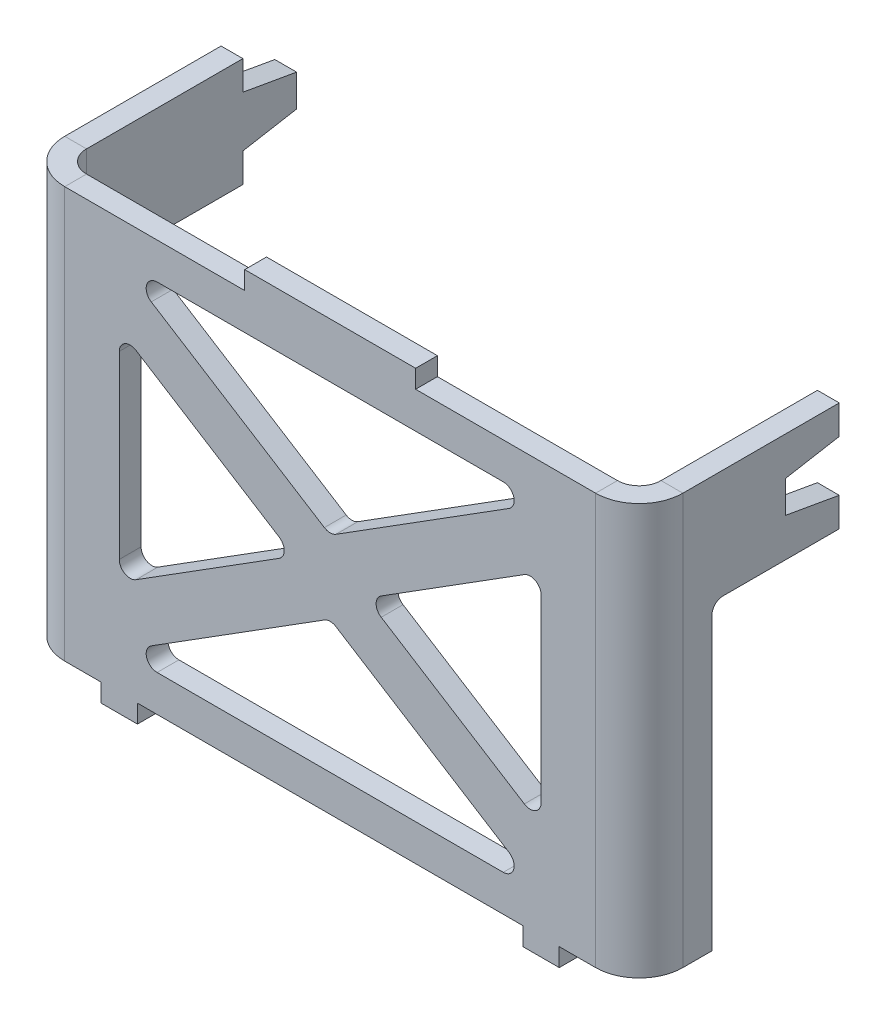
ISO-10303-21;
HEADER;
FILE_DESCRIPTION(('STEP AP214'),'2;1');
FILE_NAME('part.step','',(''),(''),'','','');
FILE_SCHEMA(('AUTOMOTIVE_DESIGN { 1 0 10303 214 1 1 1 1 }'));
ENDSEC;
DATA;
#1=APPLICATION_CONTEXT('core data for automotive mechanical design processes');
#2=APPLICATION_PROTOCOL_DEFINITION('international standard','automotive_design',2000,#1);
#3=PRODUCT_CONTEXT('',#1,'mechanical');
#4=PRODUCT('Part','Part','',(#3));
#5=PRODUCT_RELATED_PRODUCT_CATEGORY('part','',(#4));
#6=PRODUCT_DEFINITION_FORMATION('','',#4);
#7=PRODUCT_DEFINITION_CONTEXT('part definition',#1,'design');
#8=PRODUCT_DEFINITION('design','',#6,#7);
#9=PRODUCT_DEFINITION_SHAPE('','',#8);
#10=(LENGTH_UNIT() NAMED_UNIT(*) SI_UNIT(.MILLI.,.METRE.));
#11=(NAMED_UNIT(*) PLANE_ANGLE_UNIT() SI_UNIT($,.RADIAN.));
#12=(NAMED_UNIT(*) SI_UNIT($,.STERADIAN.) SOLID_ANGLE_UNIT());
#13=UNCERTAINTY_MEASURE_WITH_UNIT(LENGTH_MEASURE(1.E-05),#10,'distance_accuracy_value','');
#14=(GEOMETRIC_REPRESENTATION_CONTEXT(3) GLOBAL_UNCERTAINTY_ASSIGNED_CONTEXT((#13)) GLOBAL_UNIT_ASSIGNED_CONTEXT((#10,
#11,#12)) REPRESENTATION_CONTEXT('',''));
#15=CARTESIAN_POINT('',(0.,0.,0.));
#16=DIRECTION('',(0.,0.,1.));
#17=DIRECTION('',(1.,0.,0.));
#18=AXIS2_PLACEMENT_3D('',#15,#16,#17);
#19=CARTESIAN_POINT('',(-79.,56.5,6.));
#20=DIRECTION('',(0.,-1.,0.));
#21=DIRECTION('',(0.,0.,-1.));
#22=AXIS2_PLACEMENT_3D('',#19,#20,#21);
#23=PLANE('',#22);
#24=DIRECTION('',(0.,0.,1.));
#25=VECTOR('',#24,1.);
#26=CARTESIAN_POINT('',(-23.5,56.5,0.));
#27=LINE('',#26,#25);
#28=CARTESIAN_POINT('',(-23.5,56.5,0.));
#29=VERTEX_POINT('',#28);
#30=CARTESIAN_POINT('',(-23.5,56.5,6.));
#31=VERTEX_POINT('',#30);
#32=EDGE_CURVE('E445',#29,#31,#27,.T.);
#33=ORIENTED_EDGE('',*,*,#32,.F.);
#34=DIRECTION('',(-1.,0.,0.));
#35=VECTOR('',#34,1.);
#36=CARTESIAN_POINT('',(-79.,56.5,0.));
#37=LINE('',#36,#35);
#38=CARTESIAN_POINT('',(-73.,56.5,0.));
#39=VERTEX_POINT('',#38);
#40=EDGE_CURVE('E856',#29,#39,#37,.T.);
#41=ORIENTED_EDGE('',*,*,#40,.T.);
#42=DIRECTION('',(0.,0.,1.));
#43=VECTOR('',#42,1.);
#44=CARTESIAN_POINT('',(-73.,56.5,0.));
#45=LINE('',#44,#43);
#46=CARTESIAN_POINT('',(-73.,56.5,6.00000000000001));
#47=VERTEX_POINT('',#46);
#48=EDGE_CURVE('E791',#39,#47,#45,.T.);
#49=ORIENTED_EDGE('',*,*,#48,.T.);
#50=DIRECTION('',(-1.,0.,0.));
#51=VECTOR('',#50,1.);
#52=CARTESIAN_POINT('',(-79.,56.5,6.));
#53=LINE('',#52,#51);
#54=EDGE_CURVE('E49',#31,#47,#53,.T.);
#55=ORIENTED_EDGE('',*,*,#54,.F.);
#56=EDGE_LOOP('',(#33,#41,#49,#55));
#57=FACE_BOUND('',#56,.T.);
#58=ADVANCED_FACE('F34',(#57),#23,.F.);
#59=DIRECTION('',(0.,0.,-1.));
#60=VECTOR('',#59,1.);
#61=CARTESIAN_POINT('',(23.5,56.5,0.));
#62=LINE('',#61,#60);
#63=CARTESIAN_POINT('',(23.5,56.5,6.));
#64=VERTEX_POINT('',#63);
#65=CARTESIAN_POINT('',(23.5,56.5,0.));
#66=VERTEX_POINT('',#65);
#67=EDGE_CURVE('E57',#64,#66,#62,.T.);
#68=ORIENTED_EDGE('',*,*,#67,.F.);
#69=CARTESIAN_POINT('',(73.,56.5,6.));
#70=VERTEX_POINT('',#69);
#71=EDGE_CURVE('E859',#70,#64,#53,.T.);
#72=ORIENTED_EDGE('',*,*,#71,.F.);
#73=DIRECTION('',(0.,0.,1.));
#74=VECTOR('',#73,1.);
#75=CARTESIAN_POINT('',(73.,56.5,0.));
#76=LINE('',#75,#74);
#77=CARTESIAN_POINT('',(73.,56.5,0.));
#78=VERTEX_POINT('',#77);
#79=EDGE_CURVE('E853',#78,#70,#76,.T.);
#80=ORIENTED_EDGE('',*,*,#79,.F.);
#81=EDGE_CURVE('E867',#78,#66,#37,.T.);
#82=ORIENTED_EDGE('',*,*,#81,.T.);
#83=EDGE_LOOP('',(#68,#72,#80,#82));
#84=FACE_BOUND('',#83,.T.);
#85=ADVANCED_FACE('F955',(#84),#23,.F.);
#86=CARTESIAN_POINT('',(-79.,-56.5,6.));
#87=DIRECTION('',(0.,1.,0.));
#88=DIRECTION('',(0.,0.,1.));
#89=AXIS2_PLACEMENT_3D('',#86,#87,#88);
#90=PLANE('',#89);
#91=DIRECTION('',(0.,0.,1.));
#92=VECTOR('',#91,1.);
#93=CARTESIAN_POINT('',(63.,-56.5,5.99999999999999));
#94=LINE('',#93,#92);
#95=CARTESIAN_POINT('',(63.,-56.5,0.));
#96=VERTEX_POINT('',#95);
#97=CARTESIAN_POINT('',(63.,-56.5,6.));
#98=VERTEX_POINT('',#97);
#99=EDGE_CURVE('E446',#96,#98,#94,.T.);
#100=ORIENTED_EDGE('',*,*,#99,.F.);
#101=DIRECTION('',(1.,0.,0.));
#102=VECTOR('',#101,1.);
#103=CARTESIAN_POINT('',(-79.,-56.5,0.));
#104=LINE('',#103,#102);
#105=CARTESIAN_POINT('',(73.,-56.5,0.));
#106=VERTEX_POINT('',#105);
#107=EDGE_CURVE('E869',#96,#106,#104,.T.);
#108=ORIENTED_EDGE('',*,*,#107,.T.);
#109=DIRECTION('',(0.,0.,1.));
#110=VECTOR('',#109,1.);
#111=CARTESIAN_POINT('',(73.,-56.5,0.));
#112=LINE('',#111,#110);
#113=CARTESIAN_POINT('',(73.,-56.5,5.99999999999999));
#114=VERTEX_POINT('',#113);
#115=EDGE_CURVE('E843',#106,#114,#112,.T.);
#116=ORIENTED_EDGE('',*,*,#115,.T.);
#117=DIRECTION('',(1.,0.,0.));
#118=VECTOR('',#117,1.);
#119=CARTESIAN_POINT('',(-79.,-56.5,6.));
#120=LINE('',#119,#118);
#121=EDGE_CURVE('E861',#98,#114,#120,.T.);
#122=ORIENTED_EDGE('',*,*,#121,.F.);
#123=EDGE_LOOP('',(#100,#108,#116,#122));
#124=FACE_BOUND('',#123,.T.);
#125=ADVANCED_FACE('F960',(#124),#90,.F.);
#126=DIRECTION('',(0.,0.,-1.));
#127=VECTOR('',#126,1.);
#128=CARTESIAN_POINT('',(53.,-56.5,5.99999999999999));
#129=LINE('',#128,#127);
#130=CARTESIAN_POINT('',(53.,-56.5,6.));
#131=VERTEX_POINT('',#130);
#132=CARTESIAN_POINT('',(53.,-56.5,0.));
#133=VERTEX_POINT('',#132);
#134=EDGE_CURVE('E449',#131,#133,#129,.T.);
#135=ORIENTED_EDGE('',*,*,#134,.F.);
#136=CARTESIAN_POINT('',(-53.,-56.5,6.));
#137=VERTEX_POINT('',#136);
#138=EDGE_CURVE('E866',#137,#131,#120,.T.);
#139=ORIENTED_EDGE('',*,*,#138,.F.);
#140=DIRECTION('',(0.,0.,1.));
#141=VECTOR('',#140,1.);
#142=CARTESIAN_POINT('',(-53.,-56.5,6.00000000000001));
#143=LINE('',#142,#141);
#144=CARTESIAN_POINT('',(-53.,-56.5,0.));
#145=VERTEX_POINT('',#144);
#146=EDGE_CURVE('E478',#145,#137,#143,.T.);
#147=ORIENTED_EDGE('',*,*,#146,.F.);
#148=EDGE_CURVE('E872',#145,#133,#104,.T.);
#149=ORIENTED_EDGE('',*,*,#148,.T.);
#150=EDGE_LOOP('',(#135,#139,#147,#149));
#151=FACE_BOUND('',#150,.T.);
#152=ADVANCED_FACE('F1497',(#151),#90,.F.);
#153=DIRECTION('',(0.,0.,-1.));
#154=VECTOR('',#153,1.);
#155=CARTESIAN_POINT('',(-63.,-56.5,6.00000000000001));
#156=LINE('',#155,#154);
#157=CARTESIAN_POINT('',(-63.,-56.5,6.));
#158=VERTEX_POINT('',#157);
#159=CARTESIAN_POINT('',(-63.,-56.5,0.));
#160=VERTEX_POINT('',#159);
#161=EDGE_CURVE('E483',#158,#160,#156,.T.);
#162=ORIENTED_EDGE('',*,*,#161,.F.);
#163=CARTESIAN_POINT('',(-73.0000000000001,-56.5,6.));
#164=VERTEX_POINT('',#163);
#165=EDGE_CURVE('E862',#164,#158,#120,.T.);
#166=ORIENTED_EDGE('',*,*,#165,.F.);
#167=DIRECTION('',(0.,0.,1.));
#168=VECTOR('',#167,1.);
#169=CARTESIAN_POINT('',(-73.,-56.5,0.));
#170=LINE('',#169,#168);
#171=CARTESIAN_POINT('',(-73.,-56.5,0.));
#172=VERTEX_POINT('',#171);
#173=EDGE_CURVE('E801',#172,#164,#170,.T.);
#174=ORIENTED_EDGE('',*,*,#173,.F.);
#175=EDGE_CURVE('E870',#172,#160,#104,.T.);
#176=ORIENTED_EDGE('',*,*,#175,.T.);
#177=EDGE_LOOP('',(#162,#166,#174,#176));
#178=FACE_BOUND('',#177,.T.);
#179=ADVANCED_FACE('F1385',(#178),#90,.F.);
#180=CARTESIAN_POINT('',(-85.0000000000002,-56.5,-49.));
#181=DIRECTION('',(0.,0.,1.));
#182=DIRECTION('',(1.,0.,0.));
#183=AXIS2_PLACEMENT_3D('',#180,#181,#182);
#184=PLANE('',#183);
#185=DIRECTION('',(-1.,0.,0.));
#186=VECTOR('',#185,1.);
#187=CARTESIAN_POINT('',(-58.6477170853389,34.5,-49.0000000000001));
#188=LINE('',#187,#186);
#189=CARTESIAN_POINT('',(-79.0000000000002,34.5,-49.));
#190=VERTEX_POINT('',#189);
#191=CARTESIAN_POINT('',(-85.0000000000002,34.5,-49.));
#192=VERTEX_POINT('',#191);
#193=EDGE_CURVE('E519',#190,#192,#188,.T.);
#194=ORIENTED_EDGE('',*,*,#193,.F.);
#195=DIRECTION('',(0.,-1.,0.));
#196=VECTOR('',#195,1.);
#197=CARTESIAN_POINT('',(-79.0000000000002,-56.5,-49.));
#198=LINE('',#197,#196);
#199=CARTESIAN_POINT('',(-79.0000000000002,26.5,-49.));
#200=VERTEX_POINT('',#199);
#201=EDGE_CURVE('E771',#190,#200,#198,.T.);
#202=ORIENTED_EDGE('',*,*,#201,.T.);
#203=DIRECTION('',(-1.,0.,0.));
#204=VECTOR('',#203,1.);
#205=CARTESIAN_POINT('',(-85.0000000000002,26.5,-49.));
#206=LINE('',#205,#204);
#207=CARTESIAN_POINT('',(-85.0000000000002,26.5,-49.));
#208=VERTEX_POINT('',#207);
#209=EDGE_CURVE('E865',#200,#208,#206,.T.);
#210=ORIENTED_EDGE('',*,*,#209,.T.);
#211=DIRECTION('',(0.,-1.,0.));
#212=VECTOR('',#211,1.);
#213=CARTESIAN_POINT('',(-85.0000000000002,-56.5,-49.));
#214=LINE('',#213,#212);
#215=EDGE_CURVE('E758',#192,#208,#214,.T.);
#216=ORIENTED_EDGE('',*,*,#215,.F.);
#217=EDGE_LOOP('',(#194,#202,#210,#216));
#218=FACE_BOUND('',#217,.T.);
#219=ADVANCED_FACE('F1007',(#218),#184,.F.);
#220=CARTESIAN_POINT('',(85.,-56.5,0.));
#221=DIRECTION('',(-1.,0.,0.));
#222=DIRECTION('',(0.,0.,1.));
#223=AXIS2_PLACEMENT_3D('',#220,#221,#222);
#224=PLANE('',#223);
#225=DIRECTION('',(0.,-0.173648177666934,-0.984807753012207));
#226=VECTOR('',#225,1.);
#227=CARTESIAN_POINT('',(85.0000000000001,37.104722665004,-34.2278837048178));
#228=LINE('',#227,#226);
#229=CARTESIAN_POINT('',(85.0000000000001,37.104722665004,-34.2278837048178));
#230=VERTEX_POINT('',#229);
#231=CARTESIAN_POINT('',(85.0000000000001,34.5000000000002,-49.));
#232=VERTEX_POINT('',#231);
#233=EDGE_CURVE('E1032',#230,#232,#228,.T.);
#234=ORIENTED_EDGE('',*,*,#233,.F.);
#235=DIRECTION('',(0.,1.,0.));
#236=VECTOR('',#235,1.);
#237=CARTESIAN_POINT('',(85.0000000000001,-56.5,-34.2278837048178));
#238=LINE('',#237,#236);
#239=CARTESIAN_POINT('',(85.0000000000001,45.8952773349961,-34.2278837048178));
#240=VERTEX_POINT('',#239);
#241=EDGE_CURVE('E1028',#240,#230,#238,.F.);
#242=ORIENTED_EDGE('',*,*,#241,.F.);
#243=DIRECTION('',(0.,-0.173648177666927,0.984807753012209));
#244=VECTOR('',#243,1.);
#245=CARTESIAN_POINT('',(85.0000000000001,45.8952773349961,-34.2278837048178));
#246=LINE('',#245,#244);
#247=CARTESIAN_POINT('',(85.0000000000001,48.5,-49.));
#248=VERTEX_POINT('',#247);
#249=EDGE_CURVE('E1030',#248,#240,#246,.T.);
#250=ORIENTED_EDGE('',*,*,#249,.F.);
#251=DIRECTION('',(0.,1.,0.));
#252=VECTOR('',#251,1.);
#253=CARTESIAN_POINT('',(85.0000000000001,56.5,-49.));
#254=LINE('',#253,#252);
#255=CARTESIAN_POINT('',(85.0000000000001,56.5,-49.));
#256=VERTEX_POINT('',#255);
#257=EDGE_CURVE('E818',#248,#256,#254,.T.);
#258=ORIENTED_EDGE('',*,*,#257,.T.);
#259=DIRECTION('',(0.,0.,1.));
#260=VECTOR('',#259,1.);
#261=CARTESIAN_POINT('',(85.,56.5,0.));
#262=LINE('',#261,#260);
#263=CARTESIAN_POINT('',(85.,56.5,-5.99999999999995));
#264=VERTEX_POINT('',#263);
#265=EDGE_CURVE('E822',#256,#264,#262,.T.);
#266=ORIENTED_EDGE('',*,*,#265,.T.);
#267=DIRECTION('',(0.,1.,0.));
#268=VECTOR('',#267,1.);
#269=CARTESIAN_POINT('',(85.,-56.5,-5.99999999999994));
#270=LINE('',#269,#268);
#271=CARTESIAN_POINT('',(85.,-56.5,-5.99999999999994));
#272=VERTEX_POINT('',#271);
#273=EDGE_CURVE('E811',#272,#264,#270,.T.);
#274=ORIENTED_EDGE('',*,*,#273,.F.);
#275=DIRECTION('',(0.,0.,-1.));
#276=VECTOR('',#275,1.);
#277=CARTESIAN_POINT('',(85.0000000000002,-56.5,-49.));
#278=LINE('',#277,#276);
#279=CARTESIAN_POINT('',(85.0000000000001,-56.5,-14.0000000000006));
#280=VERTEX_POINT('',#279);
#281=EDGE_CURVE('E816',#272,#280,#278,.T.);
#282=ORIENTED_EDGE('',*,*,#281,.T.);
#283=DIRECTION('',(0.,-1.,0.));
#284=VECTOR('',#283,1.);
#285=CARTESIAN_POINT('',(85.,26.5,-14.0000000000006));
#286=LINE('',#285,#284);
#287=CARTESIAN_POINT('',(85.,23.5,-14.0000000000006));
#288=VERTEX_POINT('',#287);
#289=EDGE_CURVE('E579',#288,#280,#286,.T.);
#290=ORIENTED_EDGE('',*,*,#289,.F.);
#291=CARTESIAN_POINT('',(85.,23.5,-17.0000000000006));
#292=DIRECTION('',(-1.,0.,0.));
#293=DIRECTION('',(0.,0.,1.));
#294=AXIS2_PLACEMENT_3D('',#291,#292,#293);
#295=CIRCLE('',#294,3.);
#296=CARTESIAN_POINT('',(85.,26.5,-17.0000000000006));
#297=VERTEX_POINT('',#296);
#298=EDGE_CURVE('E11',#288,#297,#295,.T.);
#299=ORIENTED_EDGE('',*,*,#298,.T.);
#300=DIRECTION('',(0.,0.,1.));
#301=VECTOR('',#300,1.);
#302=CARTESIAN_POINT('',(85.0000000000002,26.5,-49.0000000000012));
#303=LINE('',#302,#301);
#304=CARTESIAN_POINT('',(85.0000000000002,26.5,-49.0000000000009));
#305=VERTEX_POINT('',#304);
#306=EDGE_CURVE('E576',#305,#297,#303,.T.);
#307=ORIENTED_EDGE('',*,*,#306,.F.);
#308=EDGE_CURVE('E820',#305,#232,#254,.T.);
#309=ORIENTED_EDGE('',*,*,#308,.T.);
#310=EDGE_LOOP('',(#234,#242,#250,#258,#266,#274,#282,#290,#299,#307,#309));
#311=FACE_BOUND('',#310,.T.);
#312=ADVANCED_FACE('F574',(#311),#224,.F.);
#313=CARTESIAN_POINT('',(79.,-56.5,0.));
#314=DIRECTION('',(-1.,0.,0.));
#315=DIRECTION('',(0.,0.,1.));
#316=AXIS2_PLACEMENT_3D('',#313,#314,#315);
#317=PLANE('',#316);
#318=DIRECTION('',(0.,-1.,0.));
#319=VECTOR('',#318,1.);
#320=CARTESIAN_POINT('',(79.0000000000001,45.8952773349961,-34.2278837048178));
#321=LINE('',#320,#319);
#322=CARTESIAN_POINT('',(79.0000000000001,45.8952773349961,-34.2278837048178));
#323=VERTEX_POINT('',#322);
#324=CARTESIAN_POINT('',(79.0000000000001,37.104722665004,-34.2278837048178));
#325=VERTEX_POINT('',#324);
#326=EDGE_CURVE('E1024',#323,#325,#321,.T.);
#327=ORIENTED_EDGE('',*,*,#326,.T.);
#328=DIRECTION('',(0.,-0.173648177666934,-0.984807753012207));
#329=VECTOR('',#328,1.);
#330=CARTESIAN_POINT('',(79.0000000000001,37.104722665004,-34.2278837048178));
#331=LINE('',#330,#329);
#332=CARTESIAN_POINT('',(79.0000000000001,34.5000000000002,-49.));
#333=VERTEX_POINT('',#332);
#334=EDGE_CURVE('E1031',#325,#333,#331,.T.);
#335=ORIENTED_EDGE('',*,*,#334,.T.);
#336=DIRECTION('',(0.,1.,0.));
#337=VECTOR('',#336,1.);
#338=CARTESIAN_POINT('',(79.0000000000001,56.5,-49.));
#339=LINE('',#338,#337);
#340=CARTESIAN_POINT('',(79.0000000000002,26.5,-49.));
#341=VERTEX_POINT('',#340);
#342=EDGE_CURVE('E828',#341,#333,#339,.T.);
#343=ORIENTED_EDGE('',*,*,#342,.F.);
#344=DIRECTION('',(0.,0.,-1.));
#345=VECTOR('',#344,1.);
#346=CARTESIAN_POINT('',(79.,26.5,0.));
#347=LINE('',#346,#345);
#348=CARTESIAN_POINT('',(79.,26.5,-17.0000000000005));
#349=VERTEX_POINT('',#348);
#350=EDGE_CURVE('E558',#349,#341,#347,.T.);
#351=ORIENTED_EDGE('',*,*,#350,.F.);
#352=CARTESIAN_POINT('',(79.,23.5,-17.0000000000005));
#353=DIRECTION('',(-1.,0.,0.));
#354=DIRECTION('',(0.,0.,1.));
#355=AXIS2_PLACEMENT_3D('',#352,#353,#354);
#356=CIRCLE('',#355,3.);
#357=CARTESIAN_POINT('',(79.,23.5,-14.0000000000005));
#358=VERTEX_POINT('',#357);
#359=EDGE_CURVE('E42',#349,#358,#356,.F.);
#360=ORIENTED_EDGE('',*,*,#359,.T.);
#361=DIRECTION('',(0.,1.,0.));
#362=VECTOR('',#361,1.);
#363=CARTESIAN_POINT('',(79.,-56.5,-14.0000000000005));
#364=LINE('',#363,#362);
#365=CARTESIAN_POINT('',(79.0000000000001,-56.5,-14.0000000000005));
#366=VERTEX_POINT('',#365);
#367=EDGE_CURVE('E555',#366,#358,#364,.T.);
#368=ORIENTED_EDGE('',*,*,#367,.F.);
#369=DIRECTION('',(0.,0.,-1.));
#370=VECTOR('',#369,1.);
#371=CARTESIAN_POINT('',(79.0000000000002,-56.5,-49.));
#372=LINE('',#371,#370);
#373=CARTESIAN_POINT('',(79.,-56.5,-5.99999999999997));
#374=VERTEX_POINT('',#373);
#375=EDGE_CURVE('E815',#374,#366,#372,.T.);
#376=ORIENTED_EDGE('',*,*,#375,.F.);
#377=DIRECTION('',(0.,-1.,0.));
#378=VECTOR('',#377,1.);
#379=CARTESIAN_POINT('',(79.,56.5,-5.99999999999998));
#380=LINE('',#379,#378);
#381=CARTESIAN_POINT('',(79.,56.5,-5.99999999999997));
#382=VERTEX_POINT('',#381);
#383=EDGE_CURVE('E806',#382,#374,#380,.T.);
#384=ORIENTED_EDGE('',*,*,#383,.F.);
#385=DIRECTION('',(0.,0.,1.));
#386=VECTOR('',#385,1.);
#387=CARTESIAN_POINT('',(79.,56.5,0.));
#388=LINE('',#387,#386);
#389=CARTESIAN_POINT('',(79.0000000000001,56.5,-49.));
#390=VERTEX_POINT('',#389);
#391=EDGE_CURVE('E819',#390,#382,#388,.T.);
#392=ORIENTED_EDGE('',*,*,#391,.F.);
#393=CARTESIAN_POINT('',(79.0000000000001,48.4999999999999,-49.));
#394=VERTEX_POINT('',#393);
#395=EDGE_CURVE('E827',#394,#390,#339,.T.);
#396=ORIENTED_EDGE('',*,*,#395,.F.);
#397=DIRECTION('',(0.,-0.173648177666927,0.984807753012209));
#398=VECTOR('',#397,1.);
#399=CARTESIAN_POINT('',(79.0000000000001,45.8952773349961,-34.2278837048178));
#400=LINE('',#399,#398);
#401=EDGE_CURVE('E1037',#394,#323,#400,.T.);
#402=ORIENTED_EDGE('',*,*,#401,.T.);
#403=EDGE_LOOP('',(#327,#335,#343,#351,#360,#368,#376,#384,#392,#396,#402));
#404=FACE_BOUND('',#403,.T.);
#405=ADVANCED_FACE('F553',(#404),#317,.T.);
#406=CARTESIAN_POINT('',(85.0000000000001,56.5,-49.));
#407=DIRECTION('',(0.,0.,1.));
#408=DIRECTION('',(1.,0.,0.));
#409=AXIS2_PLACEMENT_3D('',#406,#407,#408);
#410=PLANE('',#409);
#411=DIRECTION('',(-1.,0.,0.));
#412=VECTOR('',#411,1.);
#413=CARTESIAN_POINT('',(79.0000000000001,34.5000000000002,-49.));
#414=LINE('',#413,#412);
#415=EDGE_CURVE('E1045',#333,#232,#414,.F.);
#416=ORIENTED_EDGE('',*,*,#415,.T.);
#417=ORIENTED_EDGE('',*,*,#308,.F.);
#418=DIRECTION('',(-1.,0.,0.));
#419=VECTOR('',#418,1.);
#420=CARTESIAN_POINT('',(175.077744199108,26.5,-49.0000000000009));
#421=LINE('',#420,#419);
#422=EDGE_CURVE('E583',#305,#341,#421,.T.);
#423=ORIENTED_EDGE('',*,*,#422,.T.);
#424=ORIENTED_EDGE('',*,*,#342,.T.);
#425=EDGE_LOOP('',(#416,#417,#423,#424));
#426=FACE_BOUND('',#425,.T.);
#427=ADVANCED_FACE('F1059',(#426),#410,.F.);
#428=DIRECTION('',(-1.,0.,0.));
#429=VECTOR('',#428,1.);
#430=CARTESIAN_POINT('',(79.0000000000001,48.5,-49.));
#431=LINE('',#430,#429);
#432=EDGE_CURVE('E595',#394,#248,#431,.F.);
#433=ORIENTED_EDGE('',*,*,#432,.F.);
#434=ORIENTED_EDGE('',*,*,#395,.T.);
#435=DIRECTION('',(-1.,0.,0.));
#436=VECTOR('',#435,1.);
#437=CARTESIAN_POINT('',(85.0000000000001,56.5,-49.));
#438=LINE('',#437,#436);
#439=EDGE_CURVE('E825',#256,#390,#438,.T.);
#440=ORIENTED_EDGE('',*,*,#439,.F.);
#441=ORIENTED_EDGE('',*,*,#257,.F.);
#442=EDGE_LOOP('',(#433,#434,#440,#441));
#443=FACE_BOUND('',#442,.T.);
#444=ADVANCED_FACE('F1065',(#443),#410,.F.);
#445=CARTESIAN_POINT('',(79.,-56.5,6.));
#446=DIRECTION('',(0.,0.,1.));
#447=DIRECTION('',(1.,0.,0.));
#448=AXIS2_PLACEMENT_3D('',#445,#446,#447);
#449=PLANE('',#448);
#450=DIRECTION('',(0.846354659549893,-0.532619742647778,0.));
#451=VECTOR('',#450,1.);
#452=CARTESIAN_POINT('',(10.,0.,6.));
#453=LINE('',#452,#451);
#454=CARTESIAN_POINT('',(14.0346770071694,-2.53906397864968,6.));
#455=VERTEX_POINT('',#454);
#456=CARTESIAN_POINT('',(53.4021407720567,-27.3134161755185,6.));
#457=VERTEX_POINT('',#456);
#458=EDGE_CURVE('E610',#455,#457,#453,.T.);
#459=ORIENTED_EDGE('',*,*,#458,.F.);
#460=CARTESIAN_POINT('',(15.6325362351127,0.,6.));
#461=DIRECTION('',(0.,0.,1.));
#462=DIRECTION('',(1.,0.,0.));
#463=AXIS2_PLACEMENT_3D('',#460,#461,#462);
#464=CIRCLE('',#463,3.);
#465=CARTESIAN_POINT('',(14.0346770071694,2.53906397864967,6.));
#466=VERTEX_POINT('',#465);
#467=EDGE_CURVE('E901',#455,#466,#464,.F.);
#468=ORIENTED_EDGE('',*,*,#467,.T.);
#469=DIRECTION('',(-0.846354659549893,-0.532619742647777,0.));
#470=VECTOR('',#469,1.);
#471=CARTESIAN_POINT('',(53.4021407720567,27.3134161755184,6.));
#472=LINE('',#471,#470);
#473=CARTESIAN_POINT('',(53.4021407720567,27.3134161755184,6.));
#474=VERTEX_POINT('',#473);
#475=EDGE_CURVE('E621',#474,#466,#472,.T.);
#476=ORIENTED_EDGE('',*,*,#475,.F.);
#477=CARTESIAN_POINT('',(55.,24.7743521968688,6.));
#478=DIRECTION('',(0.,0.,1.));
#479=DIRECTION('',(-1.,0.,0.));
#480=AXIS2_PLACEMENT_3D('',#477,#478,#479);
#481=CIRCLE('',#480,3.);
#482=CARTESIAN_POINT('',(58.,24.7743521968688,6.));
#483=VERTEX_POINT('',#482);
#484=EDGE_CURVE('E618',#483,#474,#481,.T.);
#485=ORIENTED_EDGE('',*,*,#484,.F.);
#486=DIRECTION('',(0.,1.,0.));
#487=VECTOR('',#486,1.);
#488=CARTESIAN_POINT('',(58.,-24.7743521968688,6.));
#489=LINE('',#488,#487);
#490=CARTESIAN_POINT('',(58.,-24.7743521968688,6.));
#491=VERTEX_POINT('',#490);
#492=EDGE_CURVE('E615',#491,#483,#489,.T.);
#493=ORIENTED_EDGE('',*,*,#492,.F.);
#494=CARTESIAN_POINT('',(55.,-24.7743521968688,6.));
#495=DIRECTION('',(0.,0.,1.));
#496=DIRECTION('',(1.,0.,0.));
#497=AXIS2_PLACEMENT_3D('',#494,#495,#496);
#498=CIRCLE('',#497,3.);
#499=EDGE_CURVE('E612',#457,#491,#498,.T.);
#500=ORIENTED_EDGE('',*,*,#499,.F.);
#501=EDGE_LOOP('',(#459,#468,#476,#485,#493,#500));
#502=FACE_BOUND('',#501,.T.);
#503=DIRECTION('',(-0.846354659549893,0.532619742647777,0.));
#504=VECTOR('',#503,1.);
#505=CARTESIAN_POINT('',(-10.,0.,6.));
#506=LINE('',#505,#504);
#507=CARTESIAN_POINT('',(-14.0346770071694,2.53906397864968,6.));
#508=VERTEX_POINT('',#507);
#509=CARTESIAN_POINT('',(-53.4021407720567,27.3134161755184,6.));
#510=VERTEX_POINT('',#509);
#511=EDGE_CURVE('E646',#508,#510,#506,.T.);
#512=ORIENTED_EDGE('',*,*,#511,.F.);
#513=CARTESIAN_POINT('',(-15.6325362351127,0.,6.));
#514=DIRECTION('',(0.,0.,1.));
#515=DIRECTION('',(1.,0.,0.));
#516=AXIS2_PLACEMENT_3D('',#513,#514,#515);
#517=CIRCLE('',#516,3.);
#518=CARTESIAN_POINT('',(-14.0346770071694,-2.53906397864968,6.));
#519=VERTEX_POINT('',#518);
#520=EDGE_CURVE('E909',#508,#519,#517,.F.);
#521=ORIENTED_EDGE('',*,*,#520,.T.);
#522=DIRECTION('',(0.846354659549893,0.532619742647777,0.));
#523=VECTOR('',#522,1.);
#524=CARTESIAN_POINT('',(-53.4021407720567,-27.3134161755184,6.));
#525=LINE('',#524,#523);
#526=CARTESIAN_POINT('',(-53.4021407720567,-27.3134161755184,6.));
#527=VERTEX_POINT('',#526);
#528=EDGE_CURVE('E657',#527,#519,#525,.T.);
#529=ORIENTED_EDGE('',*,*,#528,.F.);
#530=CARTESIAN_POINT('',(-55.,-24.7743521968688,6.));
#531=DIRECTION('',(0.,0.,1.));
#532=DIRECTION('',(1.,0.,0.));
#533=AXIS2_PLACEMENT_3D('',#530,#531,#532);
#534=CIRCLE('',#533,3.);
#535=CARTESIAN_POINT('',(-58.,-24.7743521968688,6.));
#536=VERTEX_POINT('',#535);
#537=EDGE_CURVE('E654',#536,#527,#534,.T.);
#538=ORIENTED_EDGE('',*,*,#537,.F.);
#539=DIRECTION('',(0.,-1.,0.));
#540=VECTOR('',#539,1.);
#541=CARTESIAN_POINT('',(-58.,24.7743521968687,6.));
#542=LINE('',#541,#540);
#543=CARTESIAN_POINT('',(-58.,24.7743521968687,6.));
#544=VERTEX_POINT('',#543);
#545=EDGE_CURVE('E651',#544,#536,#542,.T.);
#546=ORIENTED_EDGE('',*,*,#545,.F.);
#547=CARTESIAN_POINT('',(-55.0000000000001,24.7743521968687,6.));
#548=DIRECTION('',(0.,0.,1.));
#549=DIRECTION('',(-1.,0.,0.));
#550=AXIS2_PLACEMENT_3D('',#547,#548,#549);
#551=CIRCLE('',#550,3.);
#552=EDGE_CURVE('E648',#510,#544,#551,.T.);
#553=ORIENTED_EDGE('',*,*,#552,.F.);
#554=EDGE_LOOP('',(#512,#521,#529,#538,#546,#553));
#555=FACE_BOUND('',#554,.T.);
#556=DIRECTION('',(-0.846354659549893,0.532619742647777,0.));
#557=VECTOR('',#556,1.);
#558=CARTESIAN_POINT('',(0.,-10.,6.));
#559=LINE('',#558,#557);
#560=CARTESIAN_POINT('',(49.1981997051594,-40.9609360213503,6.));
#561=VERTEX_POINT('',#560);
#562=CARTESIAN_POINT('',(1.59785922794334,-11.005549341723,6.));
#563=VERTEX_POINT('',#562);
#564=EDGE_CURVE('E682',#561,#563,#559,.T.);
#565=ORIENTED_EDGE('',*,*,#564,.F.);
#566=CARTESIAN_POINT('',(47.6003404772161,-43.5,6.));
#567=DIRECTION('',(0.,0.,1.));
#568=DIRECTION('',(1.,0.,0.));
#569=AXIS2_PLACEMENT_3D('',#566,#567,#568);
#570=CIRCLE('',#569,3.);
#571=CARTESIAN_POINT('',(47.6003404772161,-46.5,6.));
#572=VERTEX_POINT('',#571);
#573=EDGE_CURVE('E693',#572,#561,#570,.T.);
#574=ORIENTED_EDGE('',*,*,#573,.F.);
#575=DIRECTION('',(1.,0.,0.));
#576=VECTOR('',#575,1.);
#577=CARTESIAN_POINT('',(-47.6003404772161,-46.5,6.));
#578=LINE('',#577,#576);
#579=CARTESIAN_POINT('',(-47.6003404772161,-46.5,6.));
#580=VERTEX_POINT('',#579);
#581=EDGE_CURVE('E690',#580,#572,#578,.T.);
#582=ORIENTED_EDGE('',*,*,#581,.F.);
#583=CARTESIAN_POINT('',(-47.6003404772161,-43.5,6.));
#584=DIRECTION('',(0.,0.,1.));
#585=DIRECTION('',(-1.,0.,0.));
#586=AXIS2_PLACEMENT_3D('',#583,#584,#585);
#587=CIRCLE('',#586,3.);
#588=CARTESIAN_POINT('',(-49.1981997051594,-40.9609360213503,6.));
#589=VERTEX_POINT('',#588);
#590=EDGE_CURVE('E687',#589,#580,#587,.T.);
#591=ORIENTED_EDGE('',*,*,#590,.F.);
#592=DIRECTION('',(-0.846354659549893,-0.532619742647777,0.));
#593=VECTOR('',#592,1.);
#594=CARTESIAN_POINT('',(-49.1981997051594,-40.9609360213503,6.));
#595=LINE('',#594,#593);
#596=CARTESIAN_POINT('',(-1.59785922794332,-11.005549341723,6.));
#597=VERTEX_POINT('',#596);
#598=EDGE_CURVE('E685',#597,#589,#595,.T.);
#599=ORIENTED_EDGE('',*,*,#598,.F.);
#600=CARTESIAN_POINT('',(0.,-13.5446133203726,6.));
#601=DIRECTION('',(0.,0.,1.));
#602=DIRECTION('',(1.,0.,0.));
#603=AXIS2_PLACEMENT_3D('',#600,#601,#602);
#604=CIRCLE('',#603,3.);
#605=EDGE_CURVE('E897',#597,#563,#604,.F.);
#606=ORIENTED_EDGE('',*,*,#605,.T.);
#607=EDGE_LOOP('',(#565,#574,#582,#591,#599,#606));
#608=FACE_BOUND('',#607,.T.);
#609=DIRECTION('',(0.846354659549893,0.532619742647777,0.));
#610=VECTOR('',#609,1.);
#611=CARTESIAN_POINT('',(0.,10.,6.));
#612=LINE('',#611,#610);
#613=CARTESIAN_POINT('',(1.59785922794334,11.005549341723,6.));
#614=VERTEX_POINT('',#613);
#615=CARTESIAN_POINT('',(49.1981997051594,40.9609360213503,6.));
#616=VERTEX_POINT('',#615);
#617=EDGE_CURVE('E718',#614,#616,#612,.T.);
#618=ORIENTED_EDGE('',*,*,#617,.F.);
#619=CARTESIAN_POINT('',(0.,13.5446133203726,6.));
#620=DIRECTION('',(0.,0.,1.));
#621=DIRECTION('',(1.,0.,0.));
#622=AXIS2_PLACEMENT_3D('',#619,#620,#621);
#623=CIRCLE('',#622,3.);
#624=CARTESIAN_POINT('',(-1.59785922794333,11.005549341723,6.));
#625=VERTEX_POINT('',#624);
#626=EDGE_CURVE('E905',#614,#625,#623,.F.);
#627=ORIENTED_EDGE('',*,*,#626,.T.);
#628=DIRECTION('',(0.846354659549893,-0.532619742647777,0.));
#629=VECTOR('',#628,1.);
#630=CARTESIAN_POINT('',(0.,10.,6.));
#631=LINE('',#630,#629);
#632=CARTESIAN_POINT('',(-49.1981997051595,40.9609360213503,6.));
#633=VERTEX_POINT('',#632);
#634=EDGE_CURVE('E729',#633,#625,#631,.T.);
#635=ORIENTED_EDGE('',*,*,#634,.F.);
#636=CARTESIAN_POINT('',(-47.6003404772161,43.5,6.));
#637=DIRECTION('',(0.,0.,1.));
#638=DIRECTION('',(1.,0.,0.));
#639=AXIS2_PLACEMENT_3D('',#636,#637,#638);
#640=CIRCLE('',#639,3.);
#641=CARTESIAN_POINT('',(-47.6003404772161,46.5,6.));
#642=VERTEX_POINT('',#641);
#643=EDGE_CURVE('E726',#642,#633,#640,.T.);
#644=ORIENTED_EDGE('',*,*,#643,.F.);
#645=DIRECTION('',(-1.,0.,0.));
#646=VECTOR('',#645,1.);
#647=CARTESIAN_POINT('',(-47.6003404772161,46.5,6.));
#648=LINE('',#647,#646);
#649=CARTESIAN_POINT('',(47.6003404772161,46.5,6.));
#650=VERTEX_POINT('',#649);
#651=EDGE_CURVE('E723',#650,#642,#648,.T.);
#652=ORIENTED_EDGE('',*,*,#651,.F.);
#653=CARTESIAN_POINT('',(47.6003404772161,43.5,6.));
#654=DIRECTION('',(0.,0.,1.));
#655=DIRECTION('',(-1.,0.,0.));
#656=AXIS2_PLACEMENT_3D('',#653,#654,#655);
#657=CIRCLE('',#656,3.00000000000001);
#658=EDGE_CURVE('E720',#616,#650,#657,.T.);
#659=ORIENTED_EDGE('',*,*,#658,.F.);
#660=EDGE_LOOP('',(#618,#627,#635,#644,#652,#659));
#661=FACE_BOUND('',#660,.T.);
#662=ORIENTED_EDGE('',*,*,#71,.T.);
#663=DIRECTION('',(0.,-1.,0.));
#664=VECTOR('',#663,1.);
#665=CARTESIAN_POINT('',(23.5,61.5,6.));
#666=LINE('',#665,#664);
#667=CARTESIAN_POINT('',(23.5,61.5,6.));
#668=VERTEX_POINT('',#667);
#669=EDGE_CURVE('E430',#668,#64,#666,.T.);
#670=ORIENTED_EDGE('',*,*,#669,.F.);
#671=DIRECTION('',(1.,0.,0.));
#672=VECTOR('',#671,1.);
#673=CARTESIAN_POINT('',(-23.5,61.5,6.));
#674=LINE('',#673,#672);
#675=CARTESIAN_POINT('',(-23.5,61.5,6.));
#676=VERTEX_POINT('',#675);
#677=EDGE_CURVE('E423',#676,#668,#674,.T.);
#678=ORIENTED_EDGE('',*,*,#677,.F.);
#679=DIRECTION('',(0.,-1.,0.));
#680=VECTOR('',#679,1.);
#681=CARTESIAN_POINT('',(-23.5,61.5,6.));
#682=LINE('',#681,#680);
#683=EDGE_CURVE('E427',#676,#31,#682,.T.);
#684=ORIENTED_EDGE('',*,*,#683,.T.);
#685=ORIENTED_EDGE('',*,*,#54,.T.);
#686=DIRECTION('',(0.,1.,0.));
#687=VECTOR('',#686,1.);
#688=CARTESIAN_POINT('',(-73.,56.5,6.00000000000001));
#689=LINE('',#688,#687);
#690=EDGE_CURVE('E784',#47,#164,#689,.F.);
#691=ORIENTED_EDGE('',*,*,#690,.T.);
#692=ORIENTED_EDGE('',*,*,#165,.T.);
#693=DIRECTION('',(0.,1.,0.));
#694=VECTOR('',#693,1.);
#695=CARTESIAN_POINT('',(-63.,-61.5,6.00000000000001));
#696=LINE('',#695,#694);
#697=CARTESIAN_POINT('',(-63.,-61.5,6.00000000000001));
#698=VERTEX_POINT('',#697);
#699=EDGE_CURVE('E499',#698,#158,#696,.T.);
#700=ORIENTED_EDGE('',*,*,#699,.F.);
#701=DIRECTION('',(-1.,0.,0.));
#702=VECTOR('',#701,1.);
#703=CARTESIAN_POINT('',(-63.,-61.5,6.00000000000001));
#704=LINE('',#703,#702);
#705=CARTESIAN_POINT('',(-53.,-61.5,6.00000000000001));
#706=VERTEX_POINT('',#705);
#707=EDGE_CURVE('E482',#706,#698,#704,.T.);
#708=ORIENTED_EDGE('',*,*,#707,.F.);
#709=DIRECTION('',(0.,1.,0.));
#710=VECTOR('',#709,1.);
#711=CARTESIAN_POINT('',(-53.,-61.5,6.00000000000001));
#712=LINE('',#711,#710);
#713=EDGE_CURVE('E502',#706,#137,#712,.T.);
#714=ORIENTED_EDGE('',*,*,#713,.T.);
#715=ORIENTED_EDGE('',*,*,#138,.T.);
#716=DIRECTION('',(0.,1.,0.));
#717=VECTOR('',#716,1.);
#718=CARTESIAN_POINT('',(53.,-61.5,5.99999999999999));
#719=LINE('',#718,#717);
#720=CARTESIAN_POINT('',(53.,-61.5,5.99999999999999));
#721=VERTEX_POINT('',#720);
#722=EDGE_CURVE('E472',#721,#131,#719,.T.);
#723=ORIENTED_EDGE('',*,*,#722,.F.);
#724=DIRECTION('',(-1.,0.,0.));
#725=VECTOR('',#724,1.);
#726=CARTESIAN_POINT('',(53.,-61.5,5.99999999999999));
#727=LINE('',#726,#725);
#728=CARTESIAN_POINT('',(63.,-61.5,5.99999999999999));
#729=VERTEX_POINT('',#728);
#730=EDGE_CURVE('E458',#729,#721,#727,.T.);
#731=ORIENTED_EDGE('',*,*,#730,.F.);
#732=DIRECTION('',(0.,1.,0.));
#733=VECTOR('',#732,1.);
#734=CARTESIAN_POINT('',(63.,-61.5,5.99999999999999));
#735=LINE('',#734,#733);
#736=EDGE_CURVE('E475',#729,#98,#735,.T.);
#737=ORIENTED_EDGE('',*,*,#736,.T.);
#738=ORIENTED_EDGE('',*,*,#121,.T.);
#739=DIRECTION('',(0.,-1.,0.));
#740=VECTOR('',#739,1.);
#741=CARTESIAN_POINT('',(73.,-56.5,5.99999999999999));
#742=LINE('',#741,#740);
#743=EDGE_CURVE('E836',#114,#70,#742,.F.);
#744=ORIENTED_EDGE('',*,*,#743,.T.);
#745=EDGE_LOOP('',(#662,#670,#678,#684,#685,#691,#692,#700,#708,#714,#715,#723,#731,#737,#738,#744));
#746=FACE_BOUND('',#745,.T.);
#747=ADVANCED_FACE('F425',(#502,#555,#608,#661,#746),#449,.T.);
#748=CARTESIAN_POINT('',(79.,-56.5,0.));
#749=DIRECTION('',(0.,0.,1.));
#750=DIRECTION('',(1.,0.,0.));
#751=AXIS2_PLACEMENT_3D('',#748,#749,#750);
#752=PLANE('',#751);
#753=DIRECTION('',(0.846354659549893,0.532619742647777,0.));
#754=VECTOR('',#753,1.);
#755=CARTESIAN_POINT('',(53.4021407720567,27.3134161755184,0.));
#756=LINE('',#755,#754);
#757=CARTESIAN_POINT('',(14.0346770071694,2.53906397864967,0.));
#758=VERTEX_POINT('',#757);
#759=CARTESIAN_POINT('',(53.4021407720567,27.3134161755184,0.));
#760=VERTEX_POINT('',#759);
#761=EDGE_CURVE('E605',#758,#760,#756,.T.);
#762=ORIENTED_EDGE('',*,*,#761,.F.);
#763=CARTESIAN_POINT('',(15.6325362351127,0.,0.));
#764=DIRECTION('',(0.,0.,1.));
#765=DIRECTION('',(1.,0.,0.));
#766=AXIS2_PLACEMENT_3D('',#763,#764,#765);
#767=CIRCLE('',#766,3.);
#768=CARTESIAN_POINT('',(14.0346770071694,-2.53906397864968,0.));
#769=VERTEX_POINT('',#768);
#770=EDGE_CURVE('E903',#758,#769,#767,.T.);
#771=ORIENTED_EDGE('',*,*,#770,.T.);
#772=DIRECTION('',(-0.846354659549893,0.532619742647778,0.));
#773=VECTOR('',#772,1.);
#774=CARTESIAN_POINT('',(10.,0.,0.));
#775=LINE('',#774,#773);
#776=CARTESIAN_POINT('',(53.4021407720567,-27.3134161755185,0.));
#777=VERTEX_POINT('',#776);
#778=EDGE_CURVE('E607',#777,#769,#775,.T.);
#779=ORIENTED_EDGE('',*,*,#778,.F.);
#780=CARTESIAN_POINT('',(55.,-24.7743521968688,0.));
#781=DIRECTION('',(0.,0.,1.));
#782=DIRECTION('',(1.,0.,0.));
#783=AXIS2_PLACEMENT_3D('',#780,#781,#782);
#784=CIRCLE('',#783,3.);
#785=CARTESIAN_POINT('',(58.,-24.7743521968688,0.));
#786=VERTEX_POINT('',#785);
#787=EDGE_CURVE('E627',#786,#777,#784,.F.);
#788=ORIENTED_EDGE('',*,*,#787,.F.);
#789=DIRECTION('',(0.,-1.,0.));
#790=VECTOR('',#789,1.);
#791=CARTESIAN_POINT('',(58.,-24.7743521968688,0.));
#792=LINE('',#791,#790);
#793=CARTESIAN_POINT('',(58.,24.7743521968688,0.));
#794=VERTEX_POINT('',#793);
#795=EDGE_CURVE('E567',#794,#786,#792,.T.);
#796=ORIENTED_EDGE('',*,*,#795,.F.);
#797=CARTESIAN_POINT('',(55.,24.7743521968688,0.));
#798=DIRECTION('',(0.,0.,1.));
#799=DIRECTION('',(1.,0.,0.));
#800=AXIS2_PLACEMENT_3D('',#797,#798,#799);
#801=CIRCLE('',#800,3.);
#802=EDGE_CURVE('E602',#760,#794,#801,.F.);
#803=ORIENTED_EDGE('',*,*,#802,.F.);
#804=EDGE_LOOP('',(#762,#771,#779,#788,#796,#803));
#805=FACE_BOUND('',#804,.T.);
#806=DIRECTION('',(-0.846354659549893,-0.532619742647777,0.));
#807=VECTOR('',#806,1.);
#808=CARTESIAN_POINT('',(-53.4021407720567,-27.3134161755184,0.));
#809=LINE('',#808,#807);
#810=CARTESIAN_POINT('',(-14.0346770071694,-2.53906397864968,0.));
#811=VERTEX_POINT('',#810);
#812=CARTESIAN_POINT('',(-53.4021407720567,-27.3134161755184,0.));
#813=VERTEX_POINT('',#812);
#814=EDGE_CURVE('E641',#811,#813,#809,.T.);
#815=ORIENTED_EDGE('',*,*,#814,.F.);
#816=CARTESIAN_POINT('',(-15.6325362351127,0.,0.));
#817=DIRECTION('',(0.,0.,1.));
#818=DIRECTION('',(1.,0.,0.));
#819=AXIS2_PLACEMENT_3D('',#816,#817,#818);
#820=CIRCLE('',#819,3.);
#821=CARTESIAN_POINT('',(-14.0346770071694,2.53906397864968,0.));
#822=VERTEX_POINT('',#821);
#823=EDGE_CURVE('E538',#811,#822,#820,.T.);
#824=ORIENTED_EDGE('',*,*,#823,.T.);
#825=DIRECTION('',(0.846354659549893,-0.532619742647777,0.));
#826=VECTOR('',#825,1.);
#827=CARTESIAN_POINT('',(-10.,0.,0.));
#828=LINE('',#827,#826);
#829=CARTESIAN_POINT('',(-53.4021407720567,27.3134161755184,0.));
#830=VERTEX_POINT('',#829);
#831=EDGE_CURVE('E643',#830,#822,#828,.T.);
#832=ORIENTED_EDGE('',*,*,#831,.F.);
#833=CARTESIAN_POINT('',(-55.0000000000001,24.7743521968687,0.));
#834=DIRECTION('',(0.,0.,1.));
#835=DIRECTION('',(1.,0.,0.));
#836=AXIS2_PLACEMENT_3D('',#833,#834,#835);
#837=CIRCLE('',#836,3.);
#838=CARTESIAN_POINT('',(-58.,24.7743521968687,0.));
#839=VERTEX_POINT('',#838);
#840=EDGE_CURVE('E663',#839,#830,#837,.F.);
#841=ORIENTED_EDGE('',*,*,#840,.F.);
#842=DIRECTION('',(0.,1.,0.));
#843=VECTOR('',#842,1.);
#844=CARTESIAN_POINT('',(-58.,24.7743521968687,0.));
#845=LINE('',#844,#843);
#846=CARTESIAN_POINT('',(-58.,-24.7743521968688,0.));
#847=VERTEX_POINT('',#846);
#848=EDGE_CURVE('E636',#847,#839,#845,.T.);
#849=ORIENTED_EDGE('',*,*,#848,.F.);
#850=CARTESIAN_POINT('',(-55.,-24.7743521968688,0.));
#851=DIRECTION('',(0.,0.,1.));
#852=DIRECTION('',(1.,0.,0.));
#853=AXIS2_PLACEMENT_3D('',#850,#851,#852);
#854=CIRCLE('',#853,3.);
#855=EDGE_CURVE('E638',#813,#847,#854,.F.);
#856=ORIENTED_EDGE('',*,*,#855,.F.);
#857=EDGE_LOOP('',(#815,#824,#832,#841,#849,#856));
#858=FACE_BOUND('',#857,.T.);
#859=CARTESIAN_POINT('',(47.6003404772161,-43.5,0.));
#860=DIRECTION('',(0.,0.,1.));
#861=DIRECTION('',(1.,0.,0.));
#862=AXIS2_PLACEMENT_3D('',#859,#860,#861);
#863=CIRCLE('',#862,3.);
#864=CARTESIAN_POINT('',(49.1981997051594,-40.9609360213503,0.));
#865=VERTEX_POINT('',#864);
#866=CARTESIAN_POINT('',(47.6003404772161,-46.5,0.));
#867=VERTEX_POINT('',#866);
#868=EDGE_CURVE('E677',#865,#867,#863,.F.);
#869=ORIENTED_EDGE('',*,*,#868,.F.);
#870=DIRECTION('',(0.846354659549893,-0.532619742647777,0.));
#871=VECTOR('',#870,1.);
#872=CARTESIAN_POINT('',(0.,-10.,0.));
#873=LINE('',#872,#871);
#874=CARTESIAN_POINT('',(1.59785922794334,-11.005549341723,0.));
#875=VERTEX_POINT('',#874);
#876=EDGE_CURVE('E680',#875,#865,#873,.T.);
#877=ORIENTED_EDGE('',*,*,#876,.F.);
#878=CARTESIAN_POINT('',(0.,-13.5446133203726,0.));
#879=DIRECTION('',(0.,0.,1.));
#880=DIRECTION('',(1.,0.,0.));
#881=AXIS2_PLACEMENT_3D('',#878,#879,#880);
#882=CIRCLE('',#881,3.);
#883=CARTESIAN_POINT('',(-1.59785922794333,-11.005549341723,0.));
#884=VERTEX_POINT('',#883);
#885=EDGE_CURVE('E899',#875,#884,#882,.T.);
#886=ORIENTED_EDGE('',*,*,#885,.T.);
#887=DIRECTION('',(0.846354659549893,0.532619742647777,0.));
#888=VECTOR('',#887,1.);
#889=CARTESIAN_POINT('',(-49.1981997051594,-40.9609360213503,0.));
#890=LINE('',#889,#888);
#891=CARTESIAN_POINT('',(-49.1981997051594,-40.9609360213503,0.));
#892=VERTEX_POINT('',#891);
#893=EDGE_CURVE('E699',#892,#884,#890,.T.);
#894=ORIENTED_EDGE('',*,*,#893,.F.);
#895=CARTESIAN_POINT('',(-47.6003404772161,-43.5,0.));
#896=DIRECTION('',(0.,0.,1.));
#897=DIRECTION('',(1.,0.,0.));
#898=AXIS2_PLACEMENT_3D('',#895,#896,#897);
#899=CIRCLE('',#898,3.);
#900=CARTESIAN_POINT('',(-47.6003404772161,-46.5,0.));
#901=VERTEX_POINT('',#900);
#902=EDGE_CURVE('E672',#901,#892,#899,.F.);
#903=ORIENTED_EDGE('',*,*,#902,.F.);
#904=DIRECTION('',(-1.,0.,0.));
#905=VECTOR('',#904,1.);
#906=CARTESIAN_POINT('',(-47.6003404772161,-46.5,0.));
#907=LINE('',#906,#905);
#908=EDGE_CURVE('E674',#867,#901,#907,.T.);
#909=ORIENTED_EDGE('',*,*,#908,.F.);
#910=EDGE_LOOP('',(#869,#877,#886,#894,#903,#909));
#911=FACE_BOUND('',#910,.T.);
#912=DIRECTION('',(-0.846354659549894,0.532619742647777,0.));
#913=VECTOR('',#912,1.);
#914=CARTESIAN_POINT('',(0.,10.,0.));
#915=LINE('',#914,#913);
#916=CARTESIAN_POINT('',(-1.59785922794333,11.005549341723,0.));
#917=VERTEX_POINT('',#916);
#918=CARTESIAN_POINT('',(-49.1981997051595,40.9609360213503,0.));
#919=VERTEX_POINT('',#918);
#920=EDGE_CURVE('E713',#917,#919,#915,.T.);
#921=ORIENTED_EDGE('',*,*,#920,.F.);
#922=CARTESIAN_POINT('',(0.,13.5446133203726,0.));
#923=DIRECTION('',(0.,0.,1.));
#924=DIRECTION('',(1.,0.,0.));
#925=AXIS2_PLACEMENT_3D('',#922,#923,#924);
#926=CIRCLE('',#925,3.);
#927=CARTESIAN_POINT('',(1.59785922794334,11.005549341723,0.));
#928=VERTEX_POINT('',#927);
#929=EDGE_CURVE('E907',#917,#928,#926,.T.);
#930=ORIENTED_EDGE('',*,*,#929,.T.);
#931=DIRECTION('',(-0.846354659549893,-0.532619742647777,0.));
#932=VECTOR('',#931,1.);
#933=CARTESIAN_POINT('',(0.,10.,0.));
#934=LINE('',#933,#932);
#935=CARTESIAN_POINT('',(49.1981997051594,40.9609360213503,0.));
#936=VERTEX_POINT('',#935);
#937=EDGE_CURVE('E715',#936,#928,#934,.T.);
#938=ORIENTED_EDGE('',*,*,#937,.F.);
#939=CARTESIAN_POINT('',(47.6003404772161,43.5,0.));
#940=DIRECTION('',(0.,0.,1.));
#941=DIRECTION('',(1.,0.,0.));
#942=AXIS2_PLACEMENT_3D('',#939,#940,#941);
#943=CIRCLE('',#942,3.00000000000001);
#944=CARTESIAN_POINT('',(47.6003404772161,46.5,0.));
#945=VERTEX_POINT('',#944);
#946=EDGE_CURVE('E735',#945,#936,#943,.F.);
#947=ORIENTED_EDGE('',*,*,#946,.F.);
#948=DIRECTION('',(1.,0.,0.));
#949=VECTOR('',#948,1.);
#950=CARTESIAN_POINT('',(-47.6003404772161,46.5,0.));
#951=LINE('',#950,#949);
#952=CARTESIAN_POINT('',(-47.6003404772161,46.5,0.));
#953=VERTEX_POINT('',#952);
#954=EDGE_CURVE('E708',#953,#945,#951,.T.);
#955=ORIENTED_EDGE('',*,*,#954,.F.);
#956=CARTESIAN_POINT('',(-47.6003404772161,43.5,0.));
#957=DIRECTION('',(0.,0.,1.));
#958=DIRECTION('',(1.,0.,0.));
#959=AXIS2_PLACEMENT_3D('',#956,#957,#958);
#960=CIRCLE('',#959,3.);
#961=EDGE_CURVE('E710',#919,#953,#960,.F.);
#962=ORIENTED_EDGE('',*,*,#961,.F.);
#963=EDGE_LOOP('',(#921,#930,#938,#947,#955,#962));
#964=FACE_BOUND('',#963,.T.);
#965=DIRECTION('',(0.,1.,0.));
#966=VECTOR('',#965,1.);
#967=CARTESIAN_POINT('',(-73.,56.5,0.));
#968=LINE('',#967,#966);
#969=EDGE_CURVE('E797',#39,#172,#968,.F.);
#970=ORIENTED_EDGE('',*,*,#969,.F.);
#971=ORIENTED_EDGE('',*,*,#40,.F.);
#972=DIRECTION('',(0.,-1.,0.));
#973=VECTOR('',#972,1.);
#974=CARTESIAN_POINT('',(-23.5,61.5,0.));
#975=LINE('',#974,#973);
#976=CARTESIAN_POINT('',(-23.5,61.5,0.));
#977=VERTEX_POINT('',#976);
#978=EDGE_CURVE('E1628',#977,#29,#975,.T.);
#979=ORIENTED_EDGE('',*,*,#978,.F.);
#980=DIRECTION('',(-1.,0.,0.));
#981=VECTOR('',#980,1.);
#982=CARTESIAN_POINT('',(-23.5,61.5,0.));
#983=LINE('',#982,#981);
#984=CARTESIAN_POINT('',(23.5,61.5,0.));
#985=VERTEX_POINT('',#984);
#986=EDGE_CURVE('E439',#985,#977,#983,.T.);
#987=ORIENTED_EDGE('',*,*,#986,.F.);
#988=DIRECTION('',(0.,-1.,0.));
#989=VECTOR('',#988,1.);
#990=CARTESIAN_POINT('',(23.5,61.5,0.));
#991=LINE('',#990,#989);
#992=EDGE_CURVE('E451',#985,#66,#991,.T.);
#993=ORIENTED_EDGE('',*,*,#992,.T.);
#994=ORIENTED_EDGE('',*,*,#81,.F.);
#995=DIRECTION('',(0.,-1.,0.));
#996=VECTOR('',#995,1.);
#997=CARTESIAN_POINT('',(73.,-56.5,0.));
#998=LINE('',#997,#996);
#999=EDGE_CURVE('E849',#106,#78,#998,.F.);
#1000=ORIENTED_EDGE('',*,*,#999,.F.);
#1001=ORIENTED_EDGE('',*,*,#107,.F.);
#1002=DIRECTION('',(0.,1.,0.));
#1003=VECTOR('',#1002,1.);
#1004=CARTESIAN_POINT('',(63.,-61.5,0.));
#1005=LINE('',#1004,#1003);
#1006=CARTESIAN_POINT('',(63.,-61.5,0.));
#1007=VERTEX_POINT('',#1006);
#1008=EDGE_CURVE('E463',#1007,#96,#1005,.T.);
#1009=ORIENTED_EDGE('',*,*,#1008,.F.);
#1010=DIRECTION('',(1.,0.,0.));
#1011=VECTOR('',#1010,1.);
#1012=CARTESIAN_POINT('',(53.,-61.5,0.));
#1013=LINE('',#1012,#1011);
#1014=CARTESIAN_POINT('',(53.,-61.5,0.));
#1015=VERTEX_POINT('',#1014);
#1016=EDGE_CURVE('E462',#1015,#1007,#1013,.T.);
#1017=ORIENTED_EDGE('',*,*,#1016,.F.);
#1018=DIRECTION('',(0.,1.,0.));
#1019=VECTOR('',#1018,1.);
#1020=CARTESIAN_POINT('',(53.,-61.5,0.));
#1021=LINE('',#1020,#1019);
#1022=EDGE_CURVE('E469',#1015,#133,#1021,.T.);
#1023=ORIENTED_EDGE('',*,*,#1022,.T.);
#1024=ORIENTED_EDGE('',*,*,#148,.F.);
#1025=DIRECTION('',(0.,1.,0.));
#1026=VECTOR('',#1025,1.);
#1027=CARTESIAN_POINT('',(-53.,-61.5,0.));
#1028=LINE('',#1027,#1026);
#1029=CARTESIAN_POINT('',(-53.,-61.5,0.));
#1030=VERTEX_POINT('',#1029);
#1031=EDGE_CURVE('E489',#1030,#145,#1028,.T.);
#1032=ORIENTED_EDGE('',*,*,#1031,.F.);
#1033=DIRECTION('',(1.,0.,0.));
#1034=VECTOR('',#1033,1.);
#1035=CARTESIAN_POINT('',(-63.,-61.5,0.));
#1036=LINE('',#1035,#1034);
#1037=CARTESIAN_POINT('',(-63.,-61.5,0.));
#1038=VERTEX_POINT('',#1037);
#1039=EDGE_CURVE('E487',#1038,#1030,#1036,.T.);
#1040=ORIENTED_EDGE('',*,*,#1039,.F.);
#1041=DIRECTION('',(0.,1.,0.));
#1042=VECTOR('',#1041,1.);
#1043=CARTESIAN_POINT('',(-63.,-61.5,0.));
#1044=LINE('',#1043,#1042);
#1045=EDGE_CURVE('E496',#1038,#160,#1044,.T.);
#1046=ORIENTED_EDGE('',*,*,#1045,.T.);
#1047=ORIENTED_EDGE('',*,*,#175,.F.);
#1048=EDGE_LOOP('',(#970,#971,#979,#987,#993,#994,#1000,#1001,#1009,#1017,#1023,#1024,#1032,
#1040,#1046,#1047));
#1049=FACE_BOUND('',#1048,.T.);
#1050=ADVANCED_FACE('F914',(#805,#858,#911,#964,#1049),#752,.F.);
#1051=CARTESIAN_POINT('',(73.,56.5,-5.99999999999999));
#1052=DIRECTION('',(0.,1.,0.));
#1053=DIRECTION('',(0.,0.,1.));
#1054=AXIS2_PLACEMENT_3D('',#1051,#1052,#1053);
#1055=PLANE('',#1054);
#1056=DIRECTION('',(1.,0.,0.));
#1057=VECTOR('',#1056,1.);
#1058=CARTESIAN_POINT('',(79.,56.5,-5.99999999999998));
#1059=LINE('',#1058,#1057);
#1060=EDGE_CURVE('E804',#382,#264,#1059,.T.);
#1061=ORIENTED_EDGE('',*,*,#1060,.F.);
#1062=CARTESIAN_POINT('',(73.,56.5,-5.99999999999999));
#1063=DIRECTION('',(0.,-1.,0.));
#1064=DIRECTION('',(0.,0.,-1.));
#1065=AXIS2_PLACEMENT_3D('',#1062,#1063,#1064);
#1066=CIRCLE('',#1065,5.99999999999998);
#1067=EDGE_CURVE('E846',#78,#382,#1066,.F.);
#1068=ORIENTED_EDGE('',*,*,#1067,.F.);
#1069=ORIENTED_EDGE('',*,*,#79,.T.);
#1070=CARTESIAN_POINT('',(73.,56.5,-5.99999999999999));
#1071=DIRECTION('',(0.,-1.,0.));
#1072=DIRECTION('',(0.,0.,-1.));
#1073=AXIS2_PLACEMENT_3D('',#1070,#1071,#1072);
#1074=CIRCLE('',#1073,12.);
#1075=EDGE_CURVE('E839',#70,#264,#1074,.F.);
#1076=ORIENTED_EDGE('',*,*,#1075,.T.);
#1077=EDGE_LOOP('',(#1061,#1068,#1069,#1076));
#1078=FACE_BOUND('',#1077,.T.);
#1079=ADVANCED_FACE('F1074',(#1078),#1055,.T.);
#1080=CARTESIAN_POINT('',(73.,-56.5,-5.99999999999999));
#1081=DIRECTION('',(0.,1.,0.));
#1082=DIRECTION('',(0.,0.,1.));
#1083=AXIS2_PLACEMENT_3D('',#1080,#1081,#1082);
#1084=PLANE('',#1083);
#1085=CARTESIAN_POINT('',(73.,-56.5,-5.99999999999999));
#1086=DIRECTION('',(0.,-1.,0.));
#1087=DIRECTION('',(0.,0.,-1.));
#1088=AXIS2_PLACEMENT_3D('',#1085,#1086,#1087);
#1089=CIRCLE('',#1088,5.99999999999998);
#1090=EDGE_CURVE('E835',#374,#106,#1089,.T.);
#1091=ORIENTED_EDGE('',*,*,#1090,.F.);
#1092=DIRECTION('',(1.,0.,0.));
#1093=VECTOR('',#1092,1.);
#1094=CARTESIAN_POINT('',(79.,-56.5,-5.99999999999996));
#1095=LINE('',#1094,#1093);
#1096=EDGE_CURVE('E808',#374,#272,#1095,.T.);
#1097=ORIENTED_EDGE('',*,*,#1096,.T.);
#1098=CARTESIAN_POINT('',(73.,-56.5,-5.99999999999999));
#1099=DIRECTION('',(0.,-1.,0.));
#1100=DIRECTION('',(0.,0.,-1.));
#1101=AXIS2_PLACEMENT_3D('',#1098,#1099,#1100);
#1102=CIRCLE('',#1101,12.);
#1103=EDGE_CURVE('E840',#272,#114,#1102,.T.);
#1104=ORIENTED_EDGE('',*,*,#1103,.T.);
#1105=ORIENTED_EDGE('',*,*,#115,.F.);
#1106=EDGE_LOOP('',(#1091,#1097,#1104,#1105));
#1107=FACE_BOUND('',#1106,.T.);
#1108=ADVANCED_FACE('F1085',(#1107),#1084,.F.);
#1109=CARTESIAN_POINT('',(73.,-56.5,-5.99999999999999));
#1110=DIRECTION('',(0.,-1.,0.));
#1111=DIRECTION('',(1.,0.,0.));
#1112=AXIS2_PLACEMENT_3D('',#1109,#1110,#1111);
#1113=CYLINDRICAL_SURFACE('',#1112,12.);
#1114=ORIENTED_EDGE('',*,*,#743,.F.);
#1115=ORIENTED_EDGE('',*,*,#1103,.F.);
#1116=ORIENTED_EDGE('',*,*,#273,.T.);
#1117=ORIENTED_EDGE('',*,*,#1075,.F.);
#1118=EDGE_LOOP('',(#1114,#1115,#1116,#1117));
#1119=FACE_BOUND('',#1118,.T.);
#1120=ADVANCED_FACE('F1096',(#1119),#1113,.T.);
#1121=CARTESIAN_POINT('',(73.,-56.5,-5.99999999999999));
#1122=DIRECTION('',(0.,-1.,0.));
#1123=DIRECTION('',(1.,0.,0.));
#1124=AXIS2_PLACEMENT_3D('',#1121,#1122,#1123);
#1125=CYLINDRICAL_SURFACE('',#1124,5.99999999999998);
#1126=ORIENTED_EDGE('',*,*,#999,.T.);
#1127=ORIENTED_EDGE('',*,*,#1067,.T.);
#1128=ORIENTED_EDGE('',*,*,#383,.T.);
#1129=ORIENTED_EDGE('',*,*,#1090,.T.);
#1130=EDGE_LOOP('',(#1126,#1127,#1128,#1129));
#1131=FACE_BOUND('',#1130,.T.);
#1132=ADVANCED_FACE('F1078',(#1131),#1125,.F.);
#1133=CARTESIAN_POINT('',(85.0000000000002,-56.5,-49.));
#1134=DIRECTION('',(0.,1.,0.));
#1135=DIRECTION('',(0.,0.,1.));
#1136=AXIS2_PLACEMENT_3D('',#1133,#1134,#1135);
#1137=PLANE('',#1136);
#1138=ORIENTED_EDGE('',*,*,#375,.T.);
#1139=DIRECTION('',(-1.,0.,0.));
#1140=VECTOR('',#1139,1.);
#1141=CARTESIAN_POINT('',(175.077744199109,-56.5,-14.0000000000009));
#1142=LINE('',#1141,#1140);
#1143=EDGE_CURVE('E566',#280,#366,#1142,.T.);
#1144=ORIENTED_EDGE('',*,*,#1143,.F.);
#1145=ORIENTED_EDGE('',*,*,#281,.F.);
#1146=ORIENTED_EDGE('',*,*,#1096,.F.);
#1147=EDGE_LOOP('',(#1138,#1144,#1145,#1146));
#1148=FACE_BOUND('',#1147,.T.);
#1149=ADVANCED_FACE('F1083',(#1148),#1137,.F.);
#1150=CARTESIAN_POINT('',(85.,56.5,0.));
#1151=DIRECTION('',(0.,-1.,0.));
#1152=DIRECTION('',(0.,0.,-1.));
#1153=AXIS2_PLACEMENT_3D('',#1150,#1151,#1152);
#1154=PLANE('',#1153);
#1155=ORIENTED_EDGE('',*,*,#1060,.T.);
#1156=ORIENTED_EDGE('',*,*,#265,.F.);
#1157=ORIENTED_EDGE('',*,*,#439,.T.);
#1158=ORIENTED_EDGE('',*,*,#391,.T.);
#1159=EDGE_LOOP('',(#1155,#1156,#1157,#1158));
#1160=FACE_BOUND('',#1159,.T.);
#1161=ADVANCED_FACE('F1071',(#1160),#1154,.F.);
#1162=CARTESIAN_POINT('',(-73.,-56.5,-6.));
#1163=DIRECTION('',(0.,-1.,0.));
#1164=DIRECTION('',(0.,0.,-1.));
#1165=AXIS2_PLACEMENT_3D('',#1162,#1163,#1164);
#1166=PLANE('',#1165);
#1167=DIRECTION('',(-1.,0.,0.));
#1168=VECTOR('',#1167,1.);
#1169=CARTESIAN_POINT('',(-79.0000000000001,-56.5,-5.99999999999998));
#1170=LINE('',#1169,#1168);
#1171=CARTESIAN_POINT('',(-79.,-56.5,-5.99999999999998));
#1172=VERTEX_POINT('',#1171);
#1173=CARTESIAN_POINT('',(-85.,-56.5,-5.99999999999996));
#1174=VERTEX_POINT('',#1173);
#1175=EDGE_CURVE('E744',#1172,#1174,#1170,.T.);
#1176=ORIENTED_EDGE('',*,*,#1175,.F.);
#1177=CARTESIAN_POINT('',(-73.,-56.5,-6.));
#1178=DIRECTION('',(0.,1.,0.));
#1179=DIRECTION('',(0.,0.,1.));
#1180=AXIS2_PLACEMENT_3D('',#1177,#1178,#1179);
#1181=CIRCLE('',#1180,6.00000000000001);
#1182=EDGE_CURVE('E794',#172,#1172,#1181,.F.);
#1183=ORIENTED_EDGE('',*,*,#1182,.F.);
#1184=ORIENTED_EDGE('',*,*,#173,.T.);
#1185=CARTESIAN_POINT('',(-73.,-56.5,-6.));
#1186=DIRECTION('',(0.,1.,0.));
#1187=DIRECTION('',(0.,0.,1.));
#1188=AXIS2_PLACEMENT_3D('',#1185,#1186,#1187);
#1189=CIRCLE('',#1188,12.);
#1190=EDGE_CURVE('E787',#164,#1174,#1189,.F.);
#1191=ORIENTED_EDGE('',*,*,#1190,.T.);
#1192=EDGE_LOOP('',(#1176,#1183,#1184,#1191));
#1193=FACE_BOUND('',#1192,.T.);
#1194=ADVANCED_FACE('F1653',(#1193),#1166,.T.);
#1195=CARTESIAN_POINT('',(-73.,56.5,-6.));
#1196=DIRECTION('',(0.,-1.,0.));
#1197=DIRECTION('',(0.,0.,-1.));
#1198=AXIS2_PLACEMENT_3D('',#1195,#1196,#1197);
#1199=PLANE('',#1198);
#1200=CARTESIAN_POINT('',(-73.,56.5,-6.));
#1201=DIRECTION('',(0.,1.,0.));
#1202=DIRECTION('',(0.,0.,1.));
#1203=AXIS2_PLACEMENT_3D('',#1200,#1201,#1202);
#1204=CIRCLE('',#1203,6.00000000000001);
#1205=CARTESIAN_POINT('',(-79.,56.5,-5.99999999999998));
#1206=VERTEX_POINT('',#1205);
#1207=EDGE_CURVE('E783',#1206,#39,#1204,.T.);
#1208=ORIENTED_EDGE('',*,*,#1207,.F.);
#1209=DIRECTION('',(-1.,0.,0.));
#1210=VECTOR('',#1209,1.);
#1211=CARTESIAN_POINT('',(-79.0000000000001,56.5,-5.99999999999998));
#1212=LINE('',#1211,#1210);
#1213=CARTESIAN_POINT('',(-85.,56.5,-5.99999999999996));
#1214=VERTEX_POINT('',#1213);
#1215=EDGE_CURVE('E747',#1206,#1214,#1212,.T.);
#1216=ORIENTED_EDGE('',*,*,#1215,.T.);
#1217=CARTESIAN_POINT('',(-73.,56.5,-6.));
#1218=DIRECTION('',(0.,1.,0.));
#1219=DIRECTION('',(0.,0.,1.));
#1220=AXIS2_PLACEMENT_3D('',#1217,#1218,#1219);
#1221=CIRCLE('',#1220,12.);
#1222=EDGE_CURVE('E788',#1214,#47,#1221,.T.);
#1223=ORIENTED_EDGE('',*,*,#1222,.T.);
#1224=ORIENTED_EDGE('',*,*,#48,.F.);
#1225=EDGE_LOOP('',(#1208,#1216,#1223,#1224));
#1226=FACE_BOUND('',#1225,.T.);
#1227=ADVANCED_FACE('F1634',(#1226),#1199,.F.);
#1228=CARTESIAN_POINT('',(-73.,56.5,-6.));
#1229=DIRECTION('',(0.,1.,0.));
#1230=DIRECTION('',(-1.,0.,0.));
#1231=AXIS2_PLACEMENT_3D('',#1228,#1229,#1230);
#1232=CYLINDRICAL_SURFACE('',#1231,12.);
#1233=ORIENTED_EDGE('',*,*,#690,.F.);
#1234=ORIENTED_EDGE('',*,*,#1222,.F.);
#1235=DIRECTION('',(0.,-1.,0.));
#1236=VECTOR('',#1235,1.);
#1237=CARTESIAN_POINT('',(-85.,56.5,-5.99999999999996));
#1238=LINE('',#1237,#1236);
#1239=EDGE_CURVE('E750',#1214,#1174,#1238,.T.);
#1240=ORIENTED_EDGE('',*,*,#1239,.T.);
#1241=ORIENTED_EDGE('',*,*,#1190,.F.);
#1242=EDGE_LOOP('',(#1233,#1234,#1240,#1241));
#1243=FACE_BOUND('',#1242,.T.);
#1244=ADVANCED_FACE('F1650',(#1243),#1232,.T.);
#1245=CARTESIAN_POINT('',(-73.,56.5,-6.));
#1246=DIRECTION('',(0.,1.,0.));
#1247=DIRECTION('',(-1.,0.,0.));
#1248=AXIS2_PLACEMENT_3D('',#1245,#1246,#1247);
#1249=CYLINDRICAL_SURFACE('',#1248,6.00000000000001);
#1250=ORIENTED_EDGE('',*,*,#969,.T.);
#1251=ORIENTED_EDGE('',*,*,#1182,.T.);
#1252=DIRECTION('',(0.,1.,0.));
#1253=VECTOR('',#1252,1.);
#1254=CARTESIAN_POINT('',(-79.0000000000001,-56.5,-5.99999999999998));
#1255=LINE('',#1254,#1253);
#1256=EDGE_CURVE('E745',#1172,#1206,#1255,.T.);
#1257=ORIENTED_EDGE('',*,*,#1256,.T.);
#1258=ORIENTED_EDGE('',*,*,#1207,.T.);
#1259=EDGE_LOOP('',(#1250,#1251,#1257,#1258));
#1260=FACE_BOUND('',#1259,.T.);
#1261=ADVANCED_FACE('F1637',(#1260),#1249,.F.);
#1262=CARTESIAN_POINT('',(-85.0000000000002,56.5,-49.));
#1263=DIRECTION('',(0.,-1.,0.));
#1264=DIRECTION('',(0.,0.,-1.));
#1265=AXIS2_PLACEMENT_3D('',#1262,#1263,#1264);
#1266=PLANE('',#1265);
#1267=ORIENTED_EDGE('',*,*,#1215,.F.);
#1268=DIRECTION('',(0.,0.,-1.));
#1269=VECTOR('',#1268,1.);
#1270=CARTESIAN_POINT('',(-79.0000000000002,56.5,-49.));
#1271=LINE('',#1270,#1269);
#1272=CARTESIAN_POINT('',(-79.0000000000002,56.5,-49.));
#1273=VERTEX_POINT('',#1272);
#1274=EDGE_CURVE('E755',#1206,#1273,#1271,.T.);
#1275=ORIENTED_EDGE('',*,*,#1274,.T.);
#1276=DIRECTION('',(1.,0.,0.));
#1277=VECTOR('',#1276,1.);
#1278=CARTESIAN_POINT('',(-85.0000000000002,56.5,-49.));
#1279=LINE('',#1278,#1277);
#1280=CARTESIAN_POINT('',(-85.0000000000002,56.5,-49.));
#1281=VERTEX_POINT('',#1280);
#1282=EDGE_CURVE('E780',#1281,#1273,#1279,.T.);
#1283=ORIENTED_EDGE('',*,*,#1282,.F.);
#1284=DIRECTION('',(0.,0.,-1.));
#1285=VECTOR('',#1284,1.);
#1286=CARTESIAN_POINT('',(-85.0000000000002,56.5,-49.));
#1287=LINE('',#1286,#1285);
#1288=EDGE_CURVE('E756',#1214,#1281,#1287,.T.);
#1289=ORIENTED_EDGE('',*,*,#1288,.F.);
#1290=EDGE_LOOP('',(#1267,#1275,#1283,#1289));
#1291=FACE_BOUND('',#1290,.T.);
#1292=ADVANCED_FACE('F1216',(#1291),#1266,.F.);
#1293=CARTESIAN_POINT('',(-85.,-56.5,0.));
#1294=DIRECTION('',(0.,1.,0.));
#1295=DIRECTION('',(0.,0.,1.));
#1296=AXIS2_PLACEMENT_3D('',#1293,#1294,#1295);
#1297=PLANE('',#1296);
#1298=DIRECTION('',(0.,0.,1.));
#1299=VECTOR('',#1298,1.);
#1300=CARTESIAN_POINT('',(-85.,-56.5,0.));
#1301=LINE('',#1300,#1299);
#1302=CARTESIAN_POINT('',(-85.0000000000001,-56.5,-14.));
#1303=VERTEX_POINT('',#1302);
#1304=EDGE_CURVE('E762',#1303,#1174,#1301,.T.);
#1305=ORIENTED_EDGE('',*,*,#1304,.F.);
#1306=CARTESIAN_POINT('',(-79.0000000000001,-56.5,-14.));
#1307=VERTEX_POINT('',#1306);
#1308=EDGE_CURVE('E597',#1307,#1303,#1142,.T.);
#1309=ORIENTED_EDGE('',*,*,#1308,.F.);
#1310=DIRECTION('',(0.,0.,1.));
#1311=VECTOR('',#1310,1.);
#1312=CARTESIAN_POINT('',(-79.,-56.5,0.));
#1313=LINE('',#1312,#1311);
#1314=EDGE_CURVE('E759',#1307,#1172,#1313,.T.);
#1315=ORIENTED_EDGE('',*,*,#1314,.T.);
#1316=ORIENTED_EDGE('',*,*,#1175,.T.);
#1317=EDGE_LOOP('',(#1305,#1309,#1315,#1316));
#1318=FACE_BOUND('',#1317,.T.);
#1319=ADVANCED_FACE('F1210',(#1318),#1297,.F.);
#1320=CARTESIAN_POINT('',(-85.,56.5,0.));
#1321=DIRECTION('',(1.,0.,0.));
#1322=DIRECTION('',(0.,0.,-1.));
#1323=AXIS2_PLACEMENT_3D('',#1320,#1321,#1322);
#1324=PLANE('',#1323);
#1325=CARTESIAN_POINT('',(-85.0000000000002,48.5,-49.));
#1326=VERTEX_POINT('',#1325);
#1327=EDGE_CURVE('E768',#1281,#1326,#214,.T.);
#1328=ORIENTED_EDGE('',*,*,#1327,.T.);
#1329=DIRECTION('',(0.,-0.173648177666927,-0.984807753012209));
#1330=VECTOR('',#1329,1.);
#1331=CARTESIAN_POINT('',(-85.0000000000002,48.5,-49.));
#1332=LINE('',#1331,#1330);
#1333=CARTESIAN_POINT('',(-85.0000000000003,45.8952773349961,-63.7721162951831));
#1334=VERTEX_POINT('',#1333);
#1335=EDGE_CURVE('E505',#1326,#1334,#1332,.T.);
#1336=ORIENTED_EDGE('',*,*,#1335,.T.);
#1337=DIRECTION('',(0.,-1.,0.));
#1338=VECTOR('',#1337,1.);
#1339=CARTESIAN_POINT('',(-85.0000000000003,45.8952773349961,-63.7721162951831));
#1340=LINE('',#1339,#1338);
#1341=CARTESIAN_POINT('',(-85.0000000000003,37.104722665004,-63.7721162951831));
#1342=VERTEX_POINT('',#1341);
#1343=EDGE_CURVE('E506',#1334,#1342,#1340,.T.);
#1344=ORIENTED_EDGE('',*,*,#1343,.T.);
#1345=DIRECTION('',(0.,-0.17364817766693,0.984807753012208));
#1346=VECTOR('',#1345,1.);
#1347=CARTESIAN_POINT('',(-85.0000000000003,37.104722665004,-63.7721162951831));
#1348=LINE('',#1347,#1346);
#1349=EDGE_CURVE('E509',#1342,#192,#1348,.T.);
#1350=ORIENTED_EDGE('',*,*,#1349,.T.);
#1351=ORIENTED_EDGE('',*,*,#215,.T.);
#1352=DIRECTION('',(0.,0.,-1.));
#1353=VECTOR('',#1352,1.);
#1354=CARTESIAN_POINT('',(-85.0000000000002,26.5,-49.));
#1355=LINE('',#1354,#1353);
#1356=CARTESIAN_POINT('',(-85.0000000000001,26.5,-17.));
#1357=VERTEX_POINT('',#1356);
#1358=EDGE_CURVE('E594',#1357,#208,#1355,.T.);
#1359=ORIENTED_EDGE('',*,*,#1358,.F.);
#1360=CARTESIAN_POINT('',(-85.0000000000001,23.5,-17.));
#1361=DIRECTION('',(1.,0.,0.));
#1362=DIRECTION('',(0.,0.,-1.));
#1363=AXIS2_PLACEMENT_3D('',#1360,#1361,#1362);
#1364=CIRCLE('',#1363,3.);
#1365=CARTESIAN_POINT('',(-85.0000000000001,23.5,-14.));
#1366=VERTEX_POINT('',#1365);
#1367=EDGE_CURVE('E545',#1357,#1366,#1364,.T.);
#1368=ORIENTED_EDGE('',*,*,#1367,.T.);
#1369=DIRECTION('',(0.,1.,0.));
#1370=VECTOR('',#1369,1.);
#1371=CARTESIAN_POINT('',(-85.0000000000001,26.5,-14.));
#1372=LINE('',#1371,#1370);
#1373=EDGE_CURVE('E591',#1303,#1366,#1372,.T.);
#1374=ORIENTED_EDGE('',*,*,#1373,.F.);
#1375=ORIENTED_EDGE('',*,*,#1304,.T.);
#1376=ORIENTED_EDGE('',*,*,#1239,.F.);
#1377=ORIENTED_EDGE('',*,*,#1288,.T.);
#1378=EDGE_LOOP('',(#1328,#1336,#1344,#1350,#1351,#1359,#1368,#1374,#1375,#1376,#1377));
#1379=FACE_BOUND('',#1378,.T.);
#1380=ADVANCED_FACE('F1215',(#1379),#1324,.F.);
#1381=CARTESIAN_POINT('',(-79.,56.5,0.));
#1382=DIRECTION('',(1.,0.,0.));
#1383=DIRECTION('',(0.,0.,-1.));
#1384=AXIS2_PLACEMENT_3D('',#1381,#1382,#1383);
#1385=PLANE('',#1384);
#1386=DIRECTION('',(0.,0.,1.));
#1387=VECTOR('',#1386,1.);
#1388=CARTESIAN_POINT('',(-79.,26.5,0.));
#1389=LINE('',#1388,#1387);
#1390=CARTESIAN_POINT('',(-79.0000000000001,26.5,-17.));
#1391=VERTEX_POINT('',#1390);
#1392=EDGE_CURVE('E584',#200,#1391,#1389,.T.);
#1393=ORIENTED_EDGE('',*,*,#1392,.F.);
#1394=ORIENTED_EDGE('',*,*,#201,.F.);
#1395=DIRECTION('',(0.,-0.17364817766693,0.984807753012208));
#1396=VECTOR('',#1395,1.);
#1397=CARTESIAN_POINT('',(-79.0000000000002,37.104722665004,-63.7721162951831));
#1398=LINE('',#1397,#1396);
#1399=CARTESIAN_POINT('',(-79.0000000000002,37.104722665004,-63.7721162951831));
#1400=VERTEX_POINT('',#1399);
#1401=EDGE_CURVE('E523',#1400,#190,#1398,.T.);
#1402=ORIENTED_EDGE('',*,*,#1401,.F.);
#1403=DIRECTION('',(0.,-1.,0.));
#1404=VECTOR('',#1403,1.);
#1405=CARTESIAN_POINT('',(-79.0000000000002,45.8952773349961,-63.7721162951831));
#1406=LINE('',#1405,#1404);
#1407=CARTESIAN_POINT('',(-79.0000000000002,45.8952773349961,-63.7721162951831));
#1408=VERTEX_POINT('',#1407);
#1409=EDGE_CURVE('E510',#1408,#1400,#1406,.T.);
#1410=ORIENTED_EDGE('',*,*,#1409,.F.);
#1411=DIRECTION('',(0.,-0.173648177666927,-0.984807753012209));
#1412=VECTOR('',#1411,1.);
#1413=CARTESIAN_POINT('',(-79.0000000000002,48.5,-49.));
#1414=LINE('',#1413,#1412);
#1415=CARTESIAN_POINT('',(-79.0000000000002,48.5,-49.));
#1416=VERTEX_POINT('',#1415);
#1417=EDGE_CURVE('E531',#1416,#1408,#1414,.T.);
#1418=ORIENTED_EDGE('',*,*,#1417,.F.);
#1419=EDGE_CURVE('E774',#1273,#1416,#198,.T.);
#1420=ORIENTED_EDGE('',*,*,#1419,.F.);
#1421=ORIENTED_EDGE('',*,*,#1274,.F.);
#1422=ORIENTED_EDGE('',*,*,#1256,.F.);
#1423=ORIENTED_EDGE('',*,*,#1314,.F.);
#1424=DIRECTION('',(0.,-1.,0.));
#1425=VECTOR('',#1424,1.);
#1426=CARTESIAN_POINT('',(-79.0000000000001,56.5,-14.));
#1427=LINE('',#1426,#1425);
#1428=CARTESIAN_POINT('',(-79.0000000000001,23.5,-14.));
#1429=VERTEX_POINT('',#1428);
#1430=EDGE_CURVE('E875',#1429,#1307,#1427,.T.);
#1431=ORIENTED_EDGE('',*,*,#1430,.F.);
#1432=CARTESIAN_POINT('',(-79.0000000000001,23.5,-17.));
#1433=DIRECTION('',(1.,0.,0.));
#1434=DIRECTION('',(0.,0.,-1.));
#1435=AXIS2_PLACEMENT_3D('',#1432,#1433,#1434);
#1436=CIRCLE('',#1435,3.);
#1437=EDGE_CURVE('E547',#1429,#1391,#1436,.F.);
#1438=ORIENTED_EDGE('',*,*,#1437,.T.);
#1439=EDGE_LOOP('',(#1393,#1394,#1402,#1410,#1418,#1420,#1421,#1422,#1423,#1431,#1438));
#1440=FACE_BOUND('',#1439,.T.);
#1441=ADVANCED_FACE('F996',(#1440),#1385,.T.);
#1442=ORIENTED_EDGE('',*,*,#1419,.T.);
#1443=DIRECTION('',(-1.,0.,0.));
#1444=VECTOR('',#1443,1.);
#1445=CARTESIAN_POINT('',(-58.6477170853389,48.5,-49.0000000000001));
#1446=LINE('',#1445,#1444);
#1447=EDGE_CURVE('E522',#1416,#1326,#1446,.T.);
#1448=ORIENTED_EDGE('',*,*,#1447,.T.);
#1449=ORIENTED_EDGE('',*,*,#1327,.F.);
#1450=ORIENTED_EDGE('',*,*,#1282,.T.);
#1451=EDGE_LOOP('',(#1442,#1448,#1449,#1450));
#1452=FACE_BOUND('',#1451,.T.);
#1453=ADVANCED_FACE('F1233',(#1452),#184,.F.);
#1454=CARTESIAN_POINT('',(0.,10.,-49.001));
#1455=DIRECTION('',(0.532619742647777,-0.846354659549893,0.));
#1456=DIRECTION('',(0.846354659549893,0.532619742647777,0.));
#1457=AXIS2_PLACEMENT_3D('',#1454,#1455,#1456);
#1458=PLANE('',#1457);
#1459=ORIENTED_EDGE('',*,*,#937,.T.);
#1460=DIRECTION('',(0.,0.,1.));
#1461=VECTOR('',#1460,1.);
#1462=CARTESIAN_POINT('',(1.59785922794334,11.005549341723,6.));
#1463=LINE('',#1462,#1461);
#1464=EDGE_CURVE('E887',#928,#614,#1463,.T.);
#1465=ORIENTED_EDGE('',*,*,#1464,.T.);
#1466=ORIENTED_EDGE('',*,*,#617,.T.);
#1467=DIRECTION('',(0.,0.,1.));
#1468=VECTOR('',#1467,1.);
#1469=CARTESIAN_POINT('',(49.1981997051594,40.9609360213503,-49.001));
#1470=LINE('',#1469,#1468);
#1471=EDGE_CURVE('E732',#936,#616,#1470,.T.);
#1472=ORIENTED_EDGE('',*,*,#1471,.F.);
#1473=EDGE_LOOP('',(#1459,#1465,#1466,#1472));
#1474=FACE_BOUND('',#1473,.T.);
#1475=ADVANCED_FACE('F1227',(#1474),#1458,.F.);
#1476=CARTESIAN_POINT('',(0.,10.,-49.001));
#1477=DIRECTION('',(-0.532619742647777,-0.846354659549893,0.));
#1478=DIRECTION('',(0.846354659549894,-0.532619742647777,0.));
#1479=AXIS2_PLACEMENT_3D('',#1476,#1477,#1478);
#1480=PLANE('',#1479);
#1481=ORIENTED_EDGE('',*,*,#634,.T.);
#1482=DIRECTION('',(0.,0.,1.));
#1483=VECTOR('',#1482,1.);
#1484=CARTESIAN_POINT('',(-1.59785922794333,11.005549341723,0.));
#1485=LINE('',#1484,#1483);
#1486=EDGE_CURVE('E890',#625,#917,#1485,.F.);
#1487=ORIENTED_EDGE('',*,*,#1486,.T.);
#1488=ORIENTED_EDGE('',*,*,#920,.T.);
#1489=DIRECTION('',(0.,0.,1.));
#1490=VECTOR('',#1489,1.);
#1491=CARTESIAN_POINT('',(-49.1981997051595,40.9609360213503,-49.001));
#1492=LINE('',#1491,#1490);
#1493=EDGE_CURVE('E733',#919,#633,#1492,.T.);
#1494=ORIENTED_EDGE('',*,*,#1493,.T.);
#1495=EDGE_LOOP('',(#1481,#1487,#1488,#1494));
#1496=FACE_BOUND('',#1495,.T.);
#1497=ADVANCED_FACE('F1232',(#1496),#1480,.F.);
#1498=CARTESIAN_POINT('',(-47.6003404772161,43.5,-49.001));
#1499=DIRECTION('',(0.,0.,1.));
#1500=DIRECTION('',(1.,0.,0.));
#1501=AXIS2_PLACEMENT_3D('',#1498,#1499,#1500);
#1502=CYLINDRICAL_SURFACE('',#1501,3.);
#1503=ORIENTED_EDGE('',*,*,#961,.T.);
#1504=DIRECTION('',(0.,0.,1.));
#1505=VECTOR('',#1504,1.);
#1506=CARTESIAN_POINT('',(-47.6003404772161,46.5,-49.001));
#1507=LINE('',#1506,#1505);
#1508=EDGE_CURVE('E736',#953,#642,#1507,.T.);
#1509=ORIENTED_EDGE('',*,*,#1508,.T.);
#1510=ORIENTED_EDGE('',*,*,#643,.T.);
#1511=ORIENTED_EDGE('',*,*,#1493,.F.);
#1512=EDGE_LOOP('',(#1503,#1509,#1510,#1511));
#1513=FACE_BOUND('',#1512,.T.);
#1514=ADVANCED_FACE('F1246',(#1513),#1502,.F.);
#1515=CARTESIAN_POINT('',(-47.6003404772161,46.5,-49.001));
#1516=DIRECTION('',(0.,1.,0.));
#1517=DIRECTION('',(-1.,0.,0.));
#1518=AXIS2_PLACEMENT_3D('',#1515,#1516,#1517);
#1519=PLANE('',#1518);
#1520=ORIENTED_EDGE('',*,*,#954,.T.);
#1521=DIRECTION('',(0.,0.,1.));
#1522=VECTOR('',#1521,1.);
#1523=CARTESIAN_POINT('',(47.6003404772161,46.5,-49.001));
#1524=LINE('',#1523,#1522);
#1525=EDGE_CURVE('E738',#945,#650,#1524,.T.);
#1526=ORIENTED_EDGE('',*,*,#1525,.T.);
#1527=ORIENTED_EDGE('',*,*,#651,.T.);
#1528=ORIENTED_EDGE('',*,*,#1508,.F.);
#1529=EDGE_LOOP('',(#1520,#1526,#1527,#1528));
#1530=FACE_BOUND('',#1529,.T.);
#1531=ADVANCED_FACE('F1688',(#1530),#1519,.F.);
#1532=CARTESIAN_POINT('',(47.6003404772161,43.5,-49.001));
#1533=DIRECTION('',(0.,0.,1.));
#1534=DIRECTION('',(1.,0.,0.));
#1535=AXIS2_PLACEMENT_3D('',#1532,#1533,#1534);
#1536=CYLINDRICAL_SURFACE('',#1535,3.00000000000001);
#1537=ORIENTED_EDGE('',*,*,#946,.T.);
#1538=ORIENTED_EDGE('',*,*,#1471,.T.);
#1539=ORIENTED_EDGE('',*,*,#658,.T.);
#1540=ORIENTED_EDGE('',*,*,#1525,.F.);
#1541=EDGE_LOOP('',(#1537,#1538,#1539,#1540));
#1542=FACE_BOUND('',#1541,.T.);
#1543=ADVANCED_FACE('F1261',(#1542),#1536,.F.);
#1544=CARTESIAN_POINT('',(0.,-10.,-49.001));
#1545=DIRECTION('',(0.532619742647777,0.846354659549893,0.));
#1546=DIRECTION('',(-0.846354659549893,0.532619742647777,0.));
#1547=AXIS2_PLACEMENT_3D('',#1544,#1545,#1546);
#1548=PLANE('',#1547);
#1549=ORIENTED_EDGE('',*,*,#564,.T.);
#1550=DIRECTION('',(0.,0.,1.));
#1551=VECTOR('',#1550,1.);
#1552=CARTESIAN_POINT('',(1.59785922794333,-11.005549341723,0.));
#1553=LINE('',#1552,#1551);
#1554=EDGE_CURVE('E880',#563,#875,#1553,.F.);
#1555=ORIENTED_EDGE('',*,*,#1554,.T.);
#1556=ORIENTED_EDGE('',*,*,#876,.T.);
#1557=DIRECTION('',(0.,0.,1.));
#1558=VECTOR('',#1557,1.);
#1559=CARTESIAN_POINT('',(49.1981997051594,-40.9609360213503,-49.001));
#1560=LINE('',#1559,#1558);
#1561=EDGE_CURVE('E697',#865,#561,#1560,.T.);
#1562=ORIENTED_EDGE('',*,*,#1561,.T.);
#1563=EDGE_LOOP('',(#1549,#1555,#1556,#1562));
#1564=FACE_BOUND('',#1563,.T.);
#1565=ADVANCED_FACE('F1255',(#1564),#1548,.F.);
#1566=CARTESIAN_POINT('',(47.6003404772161,-43.5,-49.001));
#1567=DIRECTION('',(0.,0.,1.));
#1568=DIRECTION('',(1.,0.,0.));
#1569=AXIS2_PLACEMENT_3D('',#1566,#1567,#1568);
#1570=CYLINDRICAL_SURFACE('',#1569,3.);
#1571=ORIENTED_EDGE('',*,*,#868,.T.);
#1572=DIRECTION('',(0.,0.,1.));
#1573=VECTOR('',#1572,1.);
#1574=CARTESIAN_POINT('',(47.6003404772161,-46.5,-49.001));
#1575=LINE('',#1574,#1573);
#1576=EDGE_CURVE('E700',#867,#572,#1575,.T.);
#1577=ORIENTED_EDGE('',*,*,#1576,.T.);
#1578=ORIENTED_EDGE('',*,*,#573,.T.);
#1579=ORIENTED_EDGE('',*,*,#1561,.F.);
#1580=EDGE_LOOP('',(#1571,#1577,#1578,#1579));
#1581=FACE_BOUND('',#1580,.T.);
#1582=ADVANCED_FACE('F1260',(#1581),#1570,.F.);
#1583=CARTESIAN_POINT('',(-47.6003404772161,-46.5,-49.001));
#1584=DIRECTION('',(0.,-1.,0.));
#1585=DIRECTION('',(0.,0.,-1.));
#1586=AXIS2_PLACEMENT_3D('',#1583,#1584,#1585);
#1587=PLANE('',#1586);
#1588=ORIENTED_EDGE('',*,*,#908,.T.);
#1589=DIRECTION('',(0.,0.,1.));
#1590=VECTOR('',#1589,1.);
#1591=CARTESIAN_POINT('',(-47.6003404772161,-46.5,-49.001));
#1592=LINE('',#1591,#1590);
#1593=EDGE_CURVE('E702',#901,#580,#1592,.T.);
#1594=ORIENTED_EDGE('',*,*,#1593,.T.);
#1595=ORIENTED_EDGE('',*,*,#581,.T.);
#1596=ORIENTED_EDGE('',*,*,#1576,.F.);
#1597=EDGE_LOOP('',(#1588,#1594,#1595,#1596));
#1598=FACE_BOUND('',#1597,.T.);
#1599=ADVANCED_FACE('F1696',(#1598),#1587,.F.);
#1600=CARTESIAN_POINT('',(-47.6003404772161,-43.5,-49.001));
#1601=DIRECTION('',(0.,0.,1.));
#1602=DIRECTION('',(1.,0.,0.));
#1603=AXIS2_PLACEMENT_3D('',#1600,#1601,#1602);
#1604=CYLINDRICAL_SURFACE('',#1603,3.);
#1605=ORIENTED_EDGE('',*,*,#902,.T.);
#1606=DIRECTION('',(0.,0.,1.));
#1607=VECTOR('',#1606,1.);
#1608=CARTESIAN_POINT('',(-49.1981997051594,-40.9609360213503,-49.001));
#1609=LINE('',#1608,#1607);
#1610=EDGE_CURVE('E696',#892,#589,#1609,.T.);
#1611=ORIENTED_EDGE('',*,*,#1610,.T.);
#1612=ORIENTED_EDGE('',*,*,#590,.T.);
#1613=ORIENTED_EDGE('',*,*,#1593,.F.);
#1614=EDGE_LOOP('',(#1605,#1611,#1612,#1613));
#1615=FACE_BOUND('',#1614,.T.);
#1616=ADVANCED_FACE('F1277',(#1615),#1604,.F.);
#1617=CARTESIAN_POINT('',(-49.1981997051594,-40.9609360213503,-49.001));
#1618=DIRECTION('',(-0.532619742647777,0.846354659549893,0.));
#1619=DIRECTION('',(-0.846354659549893,-0.532619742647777,0.));
#1620=AXIS2_PLACEMENT_3D('',#1617,#1618,#1619);
#1621=PLANE('',#1620);
#1622=ORIENTED_EDGE('',*,*,#893,.T.);
#1623=DIRECTION('',(0.,0.,1.));
#1624=VECTOR('',#1623,1.);
#1625=CARTESIAN_POINT('',(-1.59785922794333,-11.005549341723,6.));
#1626=LINE('',#1625,#1624);
#1627=EDGE_CURVE('E877',#884,#597,#1626,.T.);
#1628=ORIENTED_EDGE('',*,*,#1627,.T.);
#1629=ORIENTED_EDGE('',*,*,#598,.T.);
#1630=ORIENTED_EDGE('',*,*,#1610,.F.);
#1631=EDGE_LOOP('',(#1622,#1628,#1629,#1630));
#1632=FACE_BOUND('',#1631,.T.);
#1633=ADVANCED_FACE('F1272',(#1632),#1621,.F.);
#1634=CARTESIAN_POINT('',(-10.,0.,-49.001));
#1635=DIRECTION('',(0.532619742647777,0.846354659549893,0.));
#1636=DIRECTION('',(-0.846354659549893,0.532619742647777,0.));
#1637=AXIS2_PLACEMENT_3D('',#1634,#1635,#1636);
#1638=PLANE('',#1637);
#1639=ORIENTED_EDGE('',*,*,#831,.T.);
#1640=DIRECTION('',(0.,0.,1.));
#1641=VECTOR('',#1640,1.);
#1642=CARTESIAN_POINT('',(-14.0346770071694,2.53906397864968,5.99999999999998));
#1643=LINE('',#1642,#1641);
#1644=EDGE_CURVE('E892',#822,#508,#1643,.T.);
#1645=ORIENTED_EDGE('',*,*,#1644,.T.);
#1646=ORIENTED_EDGE('',*,*,#511,.T.);
#1647=DIRECTION('',(0.,0.,1.));
#1648=VECTOR('',#1647,1.);
#1649=CARTESIAN_POINT('',(-53.4021407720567,27.3134161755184,-49.001));
#1650=LINE('',#1649,#1648);
#1651=EDGE_CURVE('E660',#830,#510,#1650,.T.);
#1652=ORIENTED_EDGE('',*,*,#1651,.F.);
#1653=EDGE_LOOP('',(#1639,#1645,#1646,#1652));
#1654=FACE_BOUND('',#1653,.T.);
#1655=ADVANCED_FACE('F922',(#1654),#1638,.F.);
#1656=CARTESIAN_POINT('',(-53.4021407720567,-27.3134161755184,-49.001));
#1657=DIRECTION('',(0.532619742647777,-0.846354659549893,0.));
#1658=DIRECTION('',(0.846354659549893,0.532619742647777,0.));
#1659=AXIS2_PLACEMENT_3D('',#1656,#1657,#1658);
#1660=PLANE('',#1659);
#1661=ORIENTED_EDGE('',*,*,#528,.T.);
#1662=DIRECTION('',(0.,0.,1.));
#1663=VECTOR('',#1662,1.);
#1664=CARTESIAN_POINT('',(-14.0346770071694,-2.53906397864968,0.));
#1665=LINE('',#1664,#1663);
#1666=EDGE_CURVE('E895',#519,#811,#1665,.F.);
#1667=ORIENTED_EDGE('',*,*,#1666,.T.);
#1668=ORIENTED_EDGE('',*,*,#814,.T.);
#1669=DIRECTION('',(0.,0.,1.));
#1670=VECTOR('',#1669,1.);
#1671=CARTESIAN_POINT('',(-53.4021407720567,-27.3134161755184,-49.001));
#1672=LINE('',#1671,#1670);
#1673=EDGE_CURVE('E661',#813,#527,#1672,.T.);
#1674=ORIENTED_EDGE('',*,*,#1673,.T.);
#1675=EDGE_LOOP('',(#1661,#1667,#1668,#1674));
#1676=FACE_BOUND('',#1675,.T.);
#1677=ADVANCED_FACE('F931',(#1676),#1660,.F.);
#1678=CARTESIAN_POINT('',(-55.,-24.7743521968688,-49.001));
#1679=DIRECTION('',(0.,0.,1.));
#1680=DIRECTION('',(1.,0.,0.));
#1681=AXIS2_PLACEMENT_3D('',#1678,#1679,#1680);
#1682=CYLINDRICAL_SURFACE('',#1681,3.);
#1683=ORIENTED_EDGE('',*,*,#855,.T.);
#1684=DIRECTION('',(0.,0.,1.));
#1685=VECTOR('',#1684,1.);
#1686=CARTESIAN_POINT('',(-58.,-24.7743521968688,-49.001));
#1687=LINE('',#1686,#1685);
#1688=EDGE_CURVE('E664',#847,#536,#1687,.T.);
#1689=ORIENTED_EDGE('',*,*,#1688,.T.);
#1690=ORIENTED_EDGE('',*,*,#537,.T.);
#1691=ORIENTED_EDGE('',*,*,#1673,.F.);
#1692=EDGE_LOOP('',(#1683,#1689,#1690,#1691));
#1693=FACE_BOUND('',#1692,.T.);
#1694=ADVANCED_FACE('F934',(#1693),#1682,.F.);
#1695=CARTESIAN_POINT('',(-58.,24.7743521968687,-49.001));
#1696=DIRECTION('',(-1.,0.,0.));
#1697=DIRECTION('',(0.,-1.,0.));
#1698=AXIS2_PLACEMENT_3D('',#1695,#1696,#1697);
#1699=PLANE('',#1698);
#1700=ORIENTED_EDGE('',*,*,#848,.T.);
#1701=DIRECTION('',(0.,0.,1.));
#1702=VECTOR('',#1701,1.);
#1703=CARTESIAN_POINT('',(-58.,24.7743521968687,-49.001));
#1704=LINE('',#1703,#1702);
#1705=EDGE_CURVE('E666',#839,#544,#1704,.T.);
#1706=ORIENTED_EDGE('',*,*,#1705,.T.);
#1707=ORIENTED_EDGE('',*,*,#545,.T.);
#1708=ORIENTED_EDGE('',*,*,#1688,.F.);
#1709=EDGE_LOOP('',(#1700,#1706,#1707,#1708));
#1710=FACE_BOUND('',#1709,.T.);
#1711=ADVANCED_FACE('F937',(#1710),#1699,.F.);
#1712=CARTESIAN_POINT('',(-55.0000000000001,24.7743521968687,-49.001));
#1713=DIRECTION('',(0.,0.,1.));
#1714=DIRECTION('',(1.,0.,0.));
#1715=AXIS2_PLACEMENT_3D('',#1712,#1713,#1714);
#1716=CYLINDRICAL_SURFACE('',#1715,3.);
#1717=ORIENTED_EDGE('',*,*,#840,.T.);
#1718=ORIENTED_EDGE('',*,*,#1651,.T.);
#1719=ORIENTED_EDGE('',*,*,#552,.T.);
#1720=ORIENTED_EDGE('',*,*,#1705,.F.);
#1721=EDGE_LOOP('',(#1717,#1718,#1719,#1720));
#1722=FACE_BOUND('',#1721,.T.);
#1723=ADVANCED_FACE('F941',(#1722),#1716,.F.);
#1724=CARTESIAN_POINT('',(10.,0.,-49.001));
#1725=DIRECTION('',(-0.532619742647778,-0.846354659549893,0.));
#1726=DIRECTION('',(0.846354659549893,-0.532619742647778,0.));
#1727=AXIS2_PLACEMENT_3D('',#1724,#1725,#1726);
#1728=PLANE('',#1727);
#1729=ORIENTED_EDGE('',*,*,#778,.T.);
#1730=DIRECTION('',(0.,0.,1.));
#1731=VECTOR('',#1730,1.);
#1732=CARTESIAN_POINT('',(14.0346770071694,-2.53906397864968,6.));
#1733=LINE('',#1732,#1731);
#1734=EDGE_CURVE('E882',#769,#455,#1733,.T.);
#1735=ORIENTED_EDGE('',*,*,#1734,.T.);
#1736=ORIENTED_EDGE('',*,*,#458,.T.);
#1737=DIRECTION('',(0.,0.,1.));
#1738=VECTOR('',#1737,1.);
#1739=CARTESIAN_POINT('',(53.4021407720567,-27.3134161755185,-49.001));
#1740=LINE('',#1739,#1738);
#1741=EDGE_CURVE('E624',#777,#457,#1740,.T.);
#1742=ORIENTED_EDGE('',*,*,#1741,.F.);
#1743=EDGE_LOOP('',(#1729,#1735,#1736,#1742));
#1744=FACE_BOUND('',#1743,.T.);
#1745=ADVANCED_FACE('F943',(#1744),#1728,.F.);
#1746=CARTESIAN_POINT('',(53.4021407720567,27.3134161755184,-49.001));
#1747=DIRECTION('',(-0.532619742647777,0.846354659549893,0.));
#1748=DIRECTION('',(-0.846354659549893,-0.532619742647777,0.));
#1749=AXIS2_PLACEMENT_3D('',#1746,#1747,#1748);
#1750=PLANE('',#1749);
#1751=ORIENTED_EDGE('',*,*,#475,.T.);
#1752=DIRECTION('',(0.,0.,1.));
#1753=VECTOR('',#1752,1.);
#1754=CARTESIAN_POINT('',(14.0346770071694,2.53906397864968,0.));
#1755=LINE('',#1754,#1753);
#1756=EDGE_CURVE('E885',#466,#758,#1755,.F.);
#1757=ORIENTED_EDGE('',*,*,#1756,.T.);
#1758=ORIENTED_EDGE('',*,*,#761,.T.);
#1759=DIRECTION('',(0.,0.,1.));
#1760=VECTOR('',#1759,1.);
#1761=CARTESIAN_POINT('',(53.4021407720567,27.3134161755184,-49.001));
#1762=LINE('',#1761,#1760);
#1763=EDGE_CURVE('E625',#760,#474,#1762,.T.);
#1764=ORIENTED_EDGE('',*,*,#1763,.T.);
#1765=EDGE_LOOP('',(#1751,#1757,#1758,#1764));
#1766=FACE_BOUND('',#1765,.T.);
#1767=ADVANCED_FACE('F949',(#1766),#1750,.F.);
#1768=CARTESIAN_POINT('',(55.,24.7743521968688,-49.001));
#1769=DIRECTION('',(0.,0.,1.));
#1770=DIRECTION('',(1.,0.,0.));
#1771=AXIS2_PLACEMENT_3D('',#1768,#1769,#1770);
#1772=CYLINDRICAL_SURFACE('',#1771,3.);
#1773=ORIENTED_EDGE('',*,*,#802,.T.);
#1774=DIRECTION('',(0.,0.,1.));
#1775=VECTOR('',#1774,1.);
#1776=CARTESIAN_POINT('',(58.,24.7743521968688,-49.001));
#1777=LINE('',#1776,#1775);
#1778=EDGE_CURVE('E628',#794,#483,#1777,.T.);
#1779=ORIENTED_EDGE('',*,*,#1778,.T.);
#1780=ORIENTED_EDGE('',*,*,#484,.T.);
#1781=ORIENTED_EDGE('',*,*,#1763,.F.);
#1782=EDGE_LOOP('',(#1773,#1779,#1780,#1781));
#1783=FACE_BOUND('',#1782,.T.);
#1784=ADVANCED_FACE('F1137',(#1783),#1772,.F.);
#1785=CARTESIAN_POINT('',(58.,-24.7743521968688,-49.001));
#1786=DIRECTION('',(1.,0.,0.));
#1787=DIRECTION('',(0.,0.,-1.));
#1788=AXIS2_PLACEMENT_3D('',#1785,#1786,#1787);
#1789=PLANE('',#1788);
#1790=ORIENTED_EDGE('',*,*,#795,.T.);
#1791=DIRECTION('',(0.,0.,1.));
#1792=VECTOR('',#1791,1.);
#1793=CARTESIAN_POINT('',(58.,-24.7743521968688,-49.001));
#1794=LINE('',#1793,#1792);
#1795=EDGE_CURVE('E630',#786,#491,#1794,.T.);
#1796=ORIENTED_EDGE('',*,*,#1795,.T.);
#1797=ORIENTED_EDGE('',*,*,#492,.T.);
#1798=ORIENTED_EDGE('',*,*,#1778,.F.);
#1799=EDGE_LOOP('',(#1790,#1796,#1797,#1798));
#1800=FACE_BOUND('',#1799,.T.);
#1801=ADVANCED_FACE('F1140',(#1800),#1789,.F.);
#1802=CARTESIAN_POINT('',(55.,-24.7743521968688,-49.001));
#1803=DIRECTION('',(0.,0.,1.));
#1804=DIRECTION('',(1.,0.,0.));
#1805=AXIS2_PLACEMENT_3D('',#1802,#1803,#1804);
#1806=CYLINDRICAL_SURFACE('',#1805,3.);
#1807=ORIENTED_EDGE('',*,*,#787,.T.);
#1808=ORIENTED_EDGE('',*,*,#1741,.T.);
#1809=ORIENTED_EDGE('',*,*,#499,.T.);
#1810=ORIENTED_EDGE('',*,*,#1795,.F.);
#1811=EDGE_LOOP('',(#1807,#1808,#1809,#1810));
#1812=FACE_BOUND('',#1811,.T.);
#1813=ADVANCED_FACE('F1125',(#1812),#1806,.F.);
#1814=CARTESIAN_POINT('',(175.077744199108,26.5,-49.0000000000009));
#1815=DIRECTION('',(0.,1.,0.));
#1816=DIRECTION('',(0.,0.,1.));
#1817=AXIS2_PLACEMENT_3D('',#1814,#1815,#1816);
#1818=PLANE('',#1817);
#1819=ORIENTED_EDGE('',*,*,#1392,.T.);
#1820=DIRECTION('',(-1.,0.,0.));
#1821=VECTOR('',#1820,1.);
#1822=CARTESIAN_POINT('',(-85.0000000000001,26.5,-17.));
#1823=LINE('',#1822,#1821);
#1824=EDGE_CURVE('E534',#1391,#1357,#1823,.T.);
#1825=ORIENTED_EDGE('',*,*,#1824,.T.);
#1826=ORIENTED_EDGE('',*,*,#1358,.T.);
#1827=ORIENTED_EDGE('',*,*,#209,.F.);
#1828=EDGE_LOOP('',(#1819,#1825,#1826,#1827));
#1829=FACE_BOUND('',#1828,.T.);
#1830=ADVANCED_FACE('F1001',(#1829),#1818,.F.);
#1831=CARTESIAN_POINT('',(175.077744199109,26.5,-14.0000000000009));
#1832=DIRECTION('',(0.,0.,1.));
#1833=DIRECTION('',(1.,0.,0.));
#1834=AXIS2_PLACEMENT_3D('',#1831,#1832,#1833);
#1835=PLANE('',#1834);
#1836=ORIENTED_EDGE('',*,*,#1373,.T.);
#1837=DIRECTION('',(-1.,0.,0.));
#1838=VECTOR('',#1837,1.);
#1839=CARTESIAN_POINT('',(-79.0000000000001,23.5,-14.));
#1840=LINE('',#1839,#1838);
#1841=EDGE_CURVE('E537',#1366,#1429,#1840,.F.);
#1842=ORIENTED_EDGE('',*,*,#1841,.T.);
#1843=ORIENTED_EDGE('',*,*,#1430,.T.);
#1844=ORIENTED_EDGE('',*,*,#1308,.T.);
#1845=EDGE_LOOP('',(#1836,#1842,#1843,#1844));
#1846=FACE_BOUND('',#1845,.T.);
#1847=ADVANCED_FACE('F1453',(#1846),#1835,.F.);
#1848=ORIENTED_EDGE('',*,*,#367,.T.);
#1849=DIRECTION('',(-1.,0.,0.));
#1850=VECTOR('',#1849,1.);
#1851=CARTESIAN_POINT('',(85.,23.5,-14.0000000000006));
#1852=LINE('',#1851,#1850);
#1853=EDGE_CURVE('E543',#358,#288,#1852,.F.);
#1854=ORIENTED_EDGE('',*,*,#1853,.T.);
#1855=ORIENTED_EDGE('',*,*,#289,.T.);
#1856=ORIENTED_EDGE('',*,*,#1143,.T.);
#1857=EDGE_LOOP('',(#1848,#1854,#1855,#1856));
#1858=FACE_BOUND('',#1857,.T.);
#1859=ADVANCED_FACE('F563',(#1858),#1835,.F.);
#1860=ORIENTED_EDGE('',*,*,#306,.T.);
#1861=DIRECTION('',(-1.,0.,0.));
#1862=VECTOR('',#1861,1.);
#1863=CARTESIAN_POINT('',(79.,26.5,-17.0000000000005));
#1864=LINE('',#1863,#1862);
#1865=EDGE_CURVE('E540',#297,#349,#1864,.T.);
#1866=ORIENTED_EDGE('',*,*,#1865,.T.);
#1867=ORIENTED_EDGE('',*,*,#350,.T.);
#1868=ORIENTED_EDGE('',*,*,#422,.F.);
#1869=EDGE_LOOP('',(#1860,#1866,#1867,#1868));
#1870=FACE_BOUND('',#1869,.T.);
#1871=ADVANCED_FACE('F581',(#1870),#1818,.F.);
#1872=CARTESIAN_POINT('',(0.,-13.5446133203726,-49.001));
#1873=DIRECTION('',(0.,0.,-1.));
#1874=DIRECTION('',(-1.,0.,0.));
#1875=AXIS2_PLACEMENT_3D('',#1872,#1873,#1874);
#1876=CYLINDRICAL_SURFACE('',#1875,3.);
#1877=ORIENTED_EDGE('',*,*,#885,.F.);
#1878=ORIENTED_EDGE('',*,*,#1554,.F.);
#1879=ORIENTED_EDGE('',*,*,#605,.F.);
#1880=ORIENTED_EDGE('',*,*,#1627,.F.);
#1881=EDGE_LOOP('',(#1877,#1878,#1879,#1880));
#1882=FACE_BOUND('',#1881,.T.);
#1883=ADVANCED_FACE('F964',(#1882),#1876,.F.);
#1884=CARTESIAN_POINT('',(15.6325362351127,0.,-49.001));
#1885=DIRECTION('',(0.,0.,-1.));
#1886=DIRECTION('',(-1.,0.,0.));
#1887=AXIS2_PLACEMENT_3D('',#1884,#1885,#1886);
#1888=CYLINDRICAL_SURFACE('',#1887,3.);
#1889=ORIENTED_EDGE('',*,*,#770,.F.);
#1890=ORIENTED_EDGE('',*,*,#1756,.F.);
#1891=ORIENTED_EDGE('',*,*,#467,.F.);
#1892=ORIENTED_EDGE('',*,*,#1734,.F.);
#1893=EDGE_LOOP('',(#1889,#1890,#1891,#1892));
#1894=FACE_BOUND('',#1893,.T.);
#1895=ADVANCED_FACE('F967',(#1894),#1888,.F.);
#1896=CARTESIAN_POINT('',(0.,13.5446133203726,-49.001));
#1897=DIRECTION('',(0.,0.,-1.));
#1898=DIRECTION('',(-1.,0.,0.));
#1899=AXIS2_PLACEMENT_3D('',#1896,#1897,#1898);
#1900=CYLINDRICAL_SURFACE('',#1899,3.);
#1901=ORIENTED_EDGE('',*,*,#929,.F.);
#1902=ORIENTED_EDGE('',*,*,#1486,.F.);
#1903=ORIENTED_EDGE('',*,*,#626,.F.);
#1904=ORIENTED_EDGE('',*,*,#1464,.F.);
#1905=EDGE_LOOP('',(#1901,#1902,#1903,#1904));
#1906=FACE_BOUND('',#1905,.T.);
#1907=ADVANCED_FACE('F971',(#1906),#1900,.F.);
#1908=CARTESIAN_POINT('',(-15.6325362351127,0.,-49.001));
#1909=DIRECTION('',(0.,0.,-1.));
#1910=DIRECTION('',(-1.,0.,0.));
#1911=AXIS2_PLACEMENT_3D('',#1908,#1909,#1910);
#1912=CYLINDRICAL_SURFACE('',#1911,3.);
#1913=ORIENTED_EDGE('',*,*,#823,.F.);
#1914=ORIENTED_EDGE('',*,*,#1666,.F.);
#1915=ORIENTED_EDGE('',*,*,#520,.F.);
#1916=ORIENTED_EDGE('',*,*,#1644,.F.);
#1917=EDGE_LOOP('',(#1913,#1914,#1915,#1916));
#1918=FACE_BOUND('',#1917,.T.);
#1919=ADVANCED_FACE('F924',(#1918),#1912,.F.);
#1920=CARTESIAN_POINT('',(79.0000000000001,37.104722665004,-34.2278837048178));
#1921=DIRECTION('',(0.,0.984807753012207,-0.173648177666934));
#1922=DIRECTION('',(0.,-0.173648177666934,-0.984807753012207));
#1923=AXIS2_PLACEMENT_3D('',#1920,#1921,#1922);
#1924=PLANE('',#1923);
#1925=ORIENTED_EDGE('',*,*,#415,.F.);
#1926=ORIENTED_EDGE('',*,*,#334,.F.);
#1927=DIRECTION('',(-1.,0.,0.));
#1928=VECTOR('',#1927,1.);
#1929=CARTESIAN_POINT('',(79.0000000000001,37.104722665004,-34.2278837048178));
#1930=LINE('',#1929,#1928);
#1931=EDGE_CURVE('E1042',#325,#230,#1930,.F.);
#1932=ORIENTED_EDGE('',*,*,#1931,.T.);
#1933=ORIENTED_EDGE('',*,*,#233,.T.);
#1934=EDGE_LOOP('',(#1925,#1926,#1932,#1933));
#1935=FACE_BOUND('',#1934,.T.);
#1936=ADVANCED_FACE('F977',(#1935),#1924,.T.);
#1937=CARTESIAN_POINT('',(79.0000000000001,45.8952773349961,-34.2278837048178));
#1938=DIRECTION('',(0.,0.,-1.));
#1939=DIRECTION('',(0.,-1.,0.));
#1940=AXIS2_PLACEMENT_3D('',#1937,#1938,#1939);
#1941=PLANE('',#1940);
#1942=ORIENTED_EDGE('',*,*,#1931,.F.);
#1943=ORIENTED_EDGE('',*,*,#326,.F.);
#1944=DIRECTION('',(-1.,0.,0.));
#1945=VECTOR('',#1944,1.);
#1946=CARTESIAN_POINT('',(79.0000000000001,45.8952773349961,-34.2278837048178));
#1947=LINE('',#1946,#1945);
#1948=EDGE_CURVE('E1034',#323,#240,#1947,.F.);
#1949=ORIENTED_EDGE('',*,*,#1948,.T.);
#1950=ORIENTED_EDGE('',*,*,#241,.T.);
#1951=EDGE_LOOP('',(#1942,#1943,#1949,#1950));
#1952=FACE_BOUND('',#1951,.T.);
#1953=ADVANCED_FACE('F1053',(#1952),#1941,.T.);
#1954=CARTESIAN_POINT('',(79.0000000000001,45.8952773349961,-34.2278837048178));
#1955=DIRECTION('',(0.,-0.984807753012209,-0.173648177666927));
#1956=DIRECTION('',(0.,-0.173648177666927,0.984807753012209));
#1957=AXIS2_PLACEMENT_3D('',#1954,#1955,#1956);
#1958=PLANE('',#1957);
#1959=ORIENTED_EDGE('',*,*,#401,.F.);
#1960=ORIENTED_EDGE('',*,*,#432,.T.);
#1961=ORIENTED_EDGE('',*,*,#249,.T.);
#1962=ORIENTED_EDGE('',*,*,#1948,.F.);
#1963=EDGE_LOOP('',(#1959,#1960,#1961,#1962));
#1964=FACE_BOUND('',#1963,.T.);
#1965=ADVANCED_FACE('F1063',(#1964),#1958,.T.);
#1966=CARTESIAN_POINT('',(-58.6477170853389,48.5,-49.0000000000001));
#1967=DIRECTION('',(0.,0.984807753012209,-0.173648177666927));
#1968=DIRECTION('',(0.,0.173648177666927,0.984807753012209));
#1969=AXIS2_PLACEMENT_3D('',#1966,#1967,#1968);
#1970=PLANE('',#1969);
#1971=ORIENTED_EDGE('',*,*,#1447,.F.);
#1972=ORIENTED_EDGE('',*,*,#1417,.T.);
#1973=DIRECTION('',(-1.,0.,0.));
#1974=VECTOR('',#1973,1.);
#1975=CARTESIAN_POINT('',(-58.6477170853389,45.8952773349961,-63.7721162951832));
#1976=LINE('',#1975,#1974);
#1977=EDGE_CURVE('E514',#1408,#1334,#1976,.T.);
#1978=ORIENTED_EDGE('',*,*,#1977,.T.);
#1979=ORIENTED_EDGE('',*,*,#1335,.F.);
#1980=EDGE_LOOP('',(#1971,#1972,#1978,#1979));
#1981=FACE_BOUND('',#1980,.T.);
#1982=ADVANCED_FACE('F1017',(#1981),#1970,.T.);
#1983=CARTESIAN_POINT('',(-58.6477170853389,45.8952773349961,-63.7721162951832));
#1984=DIRECTION('',(0.,0.,-1.));
#1985=DIRECTION('',(-1.,0.,0.));
#1986=AXIS2_PLACEMENT_3D('',#1983,#1984,#1985);
#1987=PLANE('',#1986);
#1988=ORIENTED_EDGE('',*,*,#1977,.F.);
#1989=ORIENTED_EDGE('',*,*,#1409,.T.);
#1990=DIRECTION('',(-1.,0.,0.));
#1991=VECTOR('',#1990,1.);
#1992=CARTESIAN_POINT('',(-58.6477170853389,37.104722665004,-63.7721162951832));
#1993=LINE('',#1992,#1991);
#1994=EDGE_CURVE('E513',#1400,#1342,#1993,.T.);
#1995=ORIENTED_EDGE('',*,*,#1994,.T.);
#1996=ORIENTED_EDGE('',*,*,#1343,.F.);
#1997=EDGE_LOOP('',(#1988,#1989,#1995,#1996));
#1998=FACE_BOUND('',#1997,.T.);
#1999=ADVANCED_FACE('F987',(#1998),#1987,.T.);
#2000=CARTESIAN_POINT('',(-58.6477170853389,37.104722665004,-63.7721162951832));
#2001=DIRECTION('',(0.,-0.984807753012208,-0.17364817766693));
#2002=DIRECTION('',(0.,0.17364817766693,-0.984807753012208));
#2003=AXIS2_PLACEMENT_3D('',#2000,#2001,#2002);
#2004=PLANE('',#2003);
#2005=ORIENTED_EDGE('',*,*,#1994,.F.);
#2006=ORIENTED_EDGE('',*,*,#1401,.T.);
#2007=ORIENTED_EDGE('',*,*,#193,.T.);
#2008=ORIENTED_EDGE('',*,*,#1349,.F.);
#2009=EDGE_LOOP('',(#2005,#2006,#2007,#2008));
#2010=FACE_BOUND('',#2009,.T.);
#2011=ADVANCED_FACE('F980',(#2010),#2004,.T.);
#2012=CARTESIAN_POINT('',(175.077744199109,23.5,-17.0000000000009));
#2013=DIRECTION('',(1.,0.,0.));
#2014=DIRECTION('',(0.,0.,-1.));
#2015=AXIS2_PLACEMENT_3D('',#2012,#2013,#2014);
#2016=CYLINDRICAL_SURFACE('',#2015,3.);
#2017=ORIENTED_EDGE('',*,*,#1437,.F.);
#2018=ORIENTED_EDGE('',*,*,#1841,.F.);
#2019=ORIENTED_EDGE('',*,*,#1367,.F.);
#2020=ORIENTED_EDGE('',*,*,#1824,.F.);
#2021=EDGE_LOOP('',(#2017,#2018,#2019,#2020));
#2022=FACE_BOUND('',#2021,.T.);
#2023=ADVANCED_FACE('F978',(#2022),#2016,.F.);
#2024=CARTESIAN_POINT('',(175.077744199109,23.5,-17.0000000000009));
#2025=DIRECTION('',(1.,0.,0.));
#2026=DIRECTION('',(0.,0.,-1.));
#2027=AXIS2_PLACEMENT_3D('',#2024,#2025,#2026);
#2028=CYLINDRICAL_SURFACE('',#2027,3.);
#2029=ORIENTED_EDGE('',*,*,#298,.F.);
#2030=ORIENTED_EDGE('',*,*,#1853,.F.);
#2031=ORIENTED_EDGE('',*,*,#359,.F.);
#2032=ORIENTED_EDGE('',*,*,#1865,.F.);
#2033=EDGE_LOOP('',(#2029,#2030,#2031,#2032));
#2034=FACE_BOUND('',#2033,.T.);
#2035=ADVANCED_FACE('F36',(#2034),#2028,.F.);
#2036=CARTESIAN_POINT('',(-53.,-61.5,6.00000000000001));
#2037=DIRECTION('',(-1.,0.,0.));
#2038=DIRECTION('',(0.,0.,1.));
#2039=AXIS2_PLACEMENT_3D('',#2036,#2037,#2038);
#2040=PLANE('',#2039);
#2041=ORIENTED_EDGE('',*,*,#146,.T.);
#2042=ORIENTED_EDGE('',*,*,#713,.F.);
#2043=DIRECTION('',(0.,0.,1.));
#2044=VECTOR('',#2043,1.);
#2045=CARTESIAN_POINT('',(-53.,-61.5,6.00000000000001));
#2046=LINE('',#2045,#2044);
#2047=EDGE_CURVE('E479',#1030,#706,#2046,.T.);
#2048=ORIENTED_EDGE('',*,*,#2047,.F.);
#2049=ORIENTED_EDGE('',*,*,#1031,.T.);
#2050=EDGE_LOOP('',(#2041,#2042,#2048,#2049));
#2051=FACE_BOUND('',#2050,.T.);
#2052=ADVANCED_FACE('F986',(#2051),#2040,.F.);
#2053=CARTESIAN_POINT('',(-63.,-61.5,6.00000000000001));
#2054=DIRECTION('',(1.,0.,0.));
#2055=DIRECTION('',(0.,0.,-1.));
#2056=AXIS2_PLACEMENT_3D('',#2053,#2054,#2055);
#2057=PLANE('',#2056);
#2058=ORIENTED_EDGE('',*,*,#161,.T.);
#2059=ORIENTED_EDGE('',*,*,#1045,.F.);
#2060=DIRECTION('',(0.,0.,-1.));
#2061=VECTOR('',#2060,1.);
#2062=CARTESIAN_POINT('',(-63.,-61.5,6.00000000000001));
#2063=LINE('',#2062,#2061);
#2064=EDGE_CURVE('E485',#698,#1038,#2063,.T.);
#2065=ORIENTED_EDGE('',*,*,#2064,.F.);
#2066=ORIENTED_EDGE('',*,*,#699,.T.);
#2067=EDGE_LOOP('',(#2058,#2059,#2065,#2066));
#2068=FACE_BOUND('',#2067,.T.);
#2069=ADVANCED_FACE('F1522',(#2068),#2057,.F.);
#2070=CARTESIAN_POINT('',(-53.,-61.5,0.));
#2071=DIRECTION('',(0.,-1.,0.));
#2072=DIRECTION('',(0.,0.,-1.));
#2073=AXIS2_PLACEMENT_3D('',#2070,#2071,#2072);
#2074=PLANE('',#2073);
#2075=ORIENTED_EDGE('',*,*,#2047,.T.);
#2076=ORIENTED_EDGE('',*,*,#707,.T.);
#2077=ORIENTED_EDGE('',*,*,#2064,.T.);
#2078=ORIENTED_EDGE('',*,*,#1039,.T.);
#2079=EDGE_LOOP('',(#2075,#2076,#2077,#2078));
#2080=FACE_BOUND('',#2079,.T.);
#2081=ADVANCED_FACE('F1533',(#2080),#2074,.T.);
#2082=CARTESIAN_POINT('',(63.,-61.5,5.99999999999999));
#2083=DIRECTION('',(-1.,0.,0.));
#2084=DIRECTION('',(0.,0.,1.));
#2085=AXIS2_PLACEMENT_3D('',#2082,#2083,#2084);
#2086=PLANE('',#2085);
#2087=ORIENTED_EDGE('',*,*,#99,.T.);
#2088=ORIENTED_EDGE('',*,*,#736,.F.);
#2089=DIRECTION('',(0.,0.,1.));
#2090=VECTOR('',#2089,1.);
#2091=CARTESIAN_POINT('',(63.,-61.5,5.99999999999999));
#2092=LINE('',#2091,#2090);
#2093=EDGE_CURVE('E455',#1007,#729,#2092,.T.);
#2094=ORIENTED_EDGE('',*,*,#2093,.F.);
#2095=ORIENTED_EDGE('',*,*,#1008,.T.);
#2096=EDGE_LOOP('',(#2087,#2088,#2094,#2095));
#2097=FACE_BOUND('',#2096,.T.);
#2098=ADVANCED_FACE('F1543',(#2097),#2086,.F.);
#2099=CARTESIAN_POINT('',(53.,-61.5,5.99999999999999));
#2100=DIRECTION('',(1.,0.,0.));
#2101=DIRECTION('',(0.,0.,-1.));
#2102=AXIS2_PLACEMENT_3D('',#2099,#2100,#2101);
#2103=PLANE('',#2102);
#2104=ORIENTED_EDGE('',*,*,#134,.T.);
#2105=ORIENTED_EDGE('',*,*,#1022,.F.);
#2106=DIRECTION('',(0.,0.,-1.));
#2107=VECTOR('',#2106,1.);
#2108=CARTESIAN_POINT('',(53.,-61.5,5.99999999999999));
#2109=LINE('',#2108,#2107);
#2110=EDGE_CURVE('E460',#721,#1015,#2109,.T.);
#2111=ORIENTED_EDGE('',*,*,#2110,.F.);
#2112=ORIENTED_EDGE('',*,*,#722,.T.);
#2113=EDGE_LOOP('',(#2104,#2105,#2111,#2112));
#2114=FACE_BOUND('',#2113,.T.);
#2115=ADVANCED_FACE('F1553',(#2114),#2103,.F.);
#2116=CARTESIAN_POINT('',(63.,-61.5,0.));
#2117=DIRECTION('',(0.,-1.,0.));
#2118=DIRECTION('',(0.,0.,-1.));
#2119=AXIS2_PLACEMENT_3D('',#2116,#2117,#2118);
#2120=PLANE('',#2119);
#2121=ORIENTED_EDGE('',*,*,#2093,.T.);
#2122=ORIENTED_EDGE('',*,*,#730,.T.);
#2123=ORIENTED_EDGE('',*,*,#2110,.T.);
#2124=ORIENTED_EDGE('',*,*,#1016,.T.);
#2125=EDGE_LOOP('',(#2121,#2122,#2123,#2124));
#2126=FACE_BOUND('',#2125,.T.);
#2127=ADVANCED_FACE('F1563',(#2126),#2120,.T.);
#2128=CARTESIAN_POINT('',(-23.5,61.5,0.));
#2129=DIRECTION('',(1.,0.,0.));
#2130=DIRECTION('',(0.,0.,-1.));
#2131=AXIS2_PLACEMENT_3D('',#2128,#2129,#2130);
#2132=PLANE('',#2131);
#2133=ORIENTED_EDGE('',*,*,#32,.T.);
#2134=ORIENTED_EDGE('',*,*,#683,.F.);
#2135=DIRECTION('',(0.,0.,1.));
#2136=VECTOR('',#2135,1.);
#2137=CARTESIAN_POINT('',(-23.5,61.5,0.));
#2138=LINE('',#2137,#2136);
#2139=EDGE_CURVE('E434',#977,#676,#2138,.T.);
#2140=ORIENTED_EDGE('',*,*,#2139,.F.);
#2141=ORIENTED_EDGE('',*,*,#978,.T.);
#2142=EDGE_LOOP('',(#2133,#2134,#2140,#2141));
#2143=FACE_BOUND('',#2142,.T.);
#2144=ADVANCED_FACE('F444',(#2143),#2132,.F.);
#2145=CARTESIAN_POINT('',(23.5,61.5,0.));
#2146=DIRECTION('',(-1.,0.,0.));
#2147=DIRECTION('',(0.,0.,1.));
#2148=AXIS2_PLACEMENT_3D('',#2145,#2146,#2147);
#2149=PLANE('',#2148);
#2150=ORIENTED_EDGE('',*,*,#67,.T.);
#2151=ORIENTED_EDGE('',*,*,#992,.F.);
#2152=DIRECTION('',(0.,0.,-1.));
#2153=VECTOR('',#2152,1.);
#2154=CARTESIAN_POINT('',(23.5,61.5,0.));
#2155=LINE('',#2154,#2153);
#2156=EDGE_CURVE('E433',#668,#985,#2155,.T.);
#2157=ORIENTED_EDGE('',*,*,#2156,.F.);
#2158=ORIENTED_EDGE('',*,*,#669,.T.);
#2159=EDGE_LOOP('',(#2150,#2151,#2157,#2158));
#2160=FACE_BOUND('',#2159,.T.);
#2161=ADVANCED_FACE('F1603',(#2160),#2149,.F.);
#2162=CARTESIAN_POINT('',(-23.5,61.5,6.));
#2163=DIRECTION('',(0.,1.,0.));
#2164=DIRECTION('',(0.,0.,1.));
#2165=AXIS2_PLACEMENT_3D('',#2162,#2163,#2164);
#2166=PLANE('',#2165);
#2167=ORIENTED_EDGE('',*,*,#2139,.T.);
#2168=ORIENTED_EDGE('',*,*,#677,.T.);
#2169=ORIENTED_EDGE('',*,*,#2156,.T.);
#2170=ORIENTED_EDGE('',*,*,#986,.T.);
#2171=EDGE_LOOP('',(#2167,#2168,#2169,#2170));
#2172=FACE_BOUND('',#2171,.T.);
#2173=ADVANCED_FACE('F437',(#2172),#2166,.T.);
#2174=CLOSED_SHELL('',(#58,#85,#125,#152,#179,#219,#312,#405,#427,#444,#747,#1050,#1079,#1108,
#1120,#1132,#1149,#1161,#1194,#1227,#1244,#1261,#1292,#1319,#1380,#1441,#1453,#1475,#1497,#1514,
#1531,#1543,#1565,#1582,#1599,#1616,#1633,#1655,#1677,#1694,#1711,#1723,#1745,#1767,#1784,#1801,
#1813,#1830,#1847,#1859,#1871,#1883,#1895,#1907,#1919,#1936,#1953,#1965,#1982,#1999,#2011,#2023,
#2035,#2052,#2069,#2081,#2098,#2115,#2127,#2144,#2161,#2173));
#2175=MANIFOLD_SOLID_BREP('B2',#2174);
#2176=ADVANCED_BREP_SHAPE_REPRESENTATION('',(#18,#2175),#14);
#2177=SHAPE_DEFINITION_REPRESENTATION(#9,#2176);
ENDSEC;
END-ISO-10303-21;
